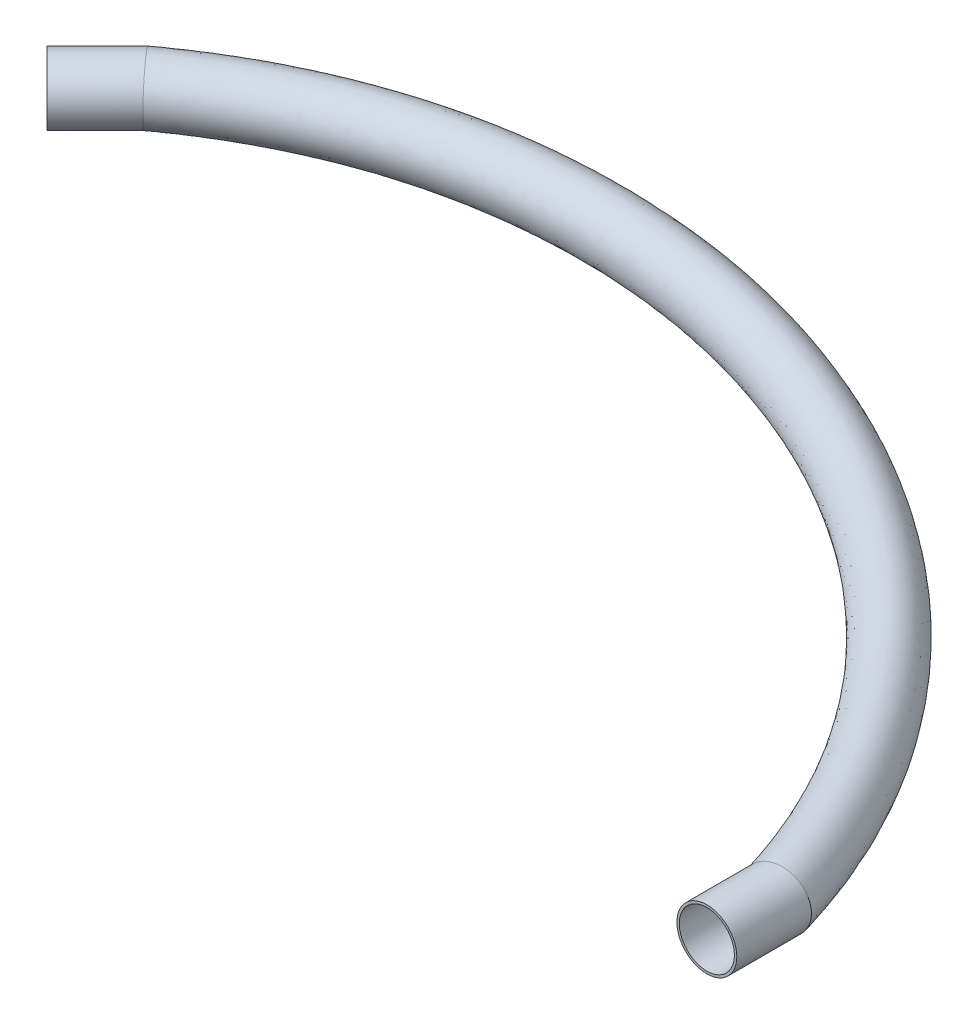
ISO-10303-21;
HEADER;
FILE_DESCRIPTION(('STEP AP214'),'2;1');
FILE_NAME('part.step','',(''),(''),'','','');
FILE_SCHEMA(('AUTOMOTIVE_DESIGN { 1 0 10303 214 1 1 1 1 }'));
ENDSEC;
DATA;
#1=APPLICATION_CONTEXT('core data for automotive mechanical design processes');
#2=APPLICATION_PROTOCOL_DEFINITION('international standard','automotive_design',2000,#1);
#3=PRODUCT_CONTEXT('',#1,'mechanical');
#4=PRODUCT('Part','Part','',(#3));
#5=PRODUCT_RELATED_PRODUCT_CATEGORY('part','',(#4));
#6=PRODUCT_DEFINITION_FORMATION('','',#4);
#7=PRODUCT_DEFINITION_CONTEXT('part definition',#1,'design');
#8=PRODUCT_DEFINITION('design','',#6,#7);
#9=PRODUCT_DEFINITION_SHAPE('','',#8);
#10=(LENGTH_UNIT() NAMED_UNIT(*) SI_UNIT(.MILLI.,.METRE.));
#11=(NAMED_UNIT(*) PLANE_ANGLE_UNIT() SI_UNIT($,.RADIAN.));
#12=(NAMED_UNIT(*) SI_UNIT($,.STERADIAN.) SOLID_ANGLE_UNIT());
#13=UNCERTAINTY_MEASURE_WITH_UNIT(LENGTH_MEASURE(1.E-05),#10,'distance_accuracy_value','');
#14=(GEOMETRIC_REPRESENTATION_CONTEXT(3) GLOBAL_UNCERTAINTY_ASSIGNED_CONTEXT((#13)) GLOBAL_UNIT_ASSIGNED_CONTEXT((#10,
#11,#12)) REPRESENTATION_CONTEXT('',''));
#15=CARTESIAN_POINT('',(0.,0.,0.));
#16=DIRECTION('',(0.,0.,1.));
#17=DIRECTION('',(1.,0.,0.));
#18=AXIS2_PLACEMENT_3D('',#15,#16,#17);
#19=CARTESIAN_POINT('',(-422.375522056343,35.4794525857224,-115.113122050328));
#20=DIRECTION('',(-0.707106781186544,0.,0.707106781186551));
#21=DIRECTION('',(0.707106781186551,0.,0.707106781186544));
#22=AXIS2_PLACEMENT_3D('',#19,#20,#21);
#23=CYLINDRICAL_SURFACE('',#22,21.75);
#24=CARTESIAN_POINT('',(-423.744724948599,13.7294525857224,-113.743919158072));
#25=CARTESIAN_POINT('',(-423.728343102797,13.7294525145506,-113.724813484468));
#26=CARTESIAN_POINT('',(-423.71196087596,13.7294959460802,-113.705707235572));
#27=CARTESIAN_POINT('',(-423.296304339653,13.7317014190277,-113.220932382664));
#28=CARTESIAN_POINT('',(-422.896879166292,13.7596551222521,-112.755010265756));
#29=CARTESIAN_POINT('',(-422.300097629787,13.8401695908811,-112.058760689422));
#30=CARTESIAN_POINT('',(-422.101480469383,13.8734604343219,-111.8270199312));
#31=CARTESIAN_POINT('',(-421.705300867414,13.9528616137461,-111.36473101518));
#32=CARTESIAN_POINT('',(-421.507738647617,13.9989745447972,-111.134183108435));
#33=CARTESIAN_POINT('',(-420.916321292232,14.1566800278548,-110.443963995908));
#34=CARTESIAN_POINT('',(-420.524602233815,14.2875223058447,-109.98672864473));
#35=CARTESIAN_POINT('',(-419.749806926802,14.5995419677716,-109.082199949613));
#36=CARTESIAN_POINT('',(-419.366730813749,14.7807201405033,-108.634906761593));
#37=CARTESIAN_POINT('',(-418.800906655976,15.0891144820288,-107.974125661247));
#38=CARTESIAN_POINT('',(-418.613828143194,15.1979721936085,-107.755633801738));
#39=CARTESIAN_POINT('',(-418.242890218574,15.427693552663,-107.322375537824));
#40=CARTESIAN_POINT('',(-418.059029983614,15.5485540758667,-107.107608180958));
#41=CARTESIAN_POINT('',(-417.512648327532,15.9289161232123,-106.469329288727));
#42=CARTESIAN_POINT('',(-417.15530798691,16.2062079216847,-106.051819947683));
#43=CARTESIAN_POINT('',(-416.457467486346,16.8059325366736,-105.236354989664));
#44=CARTESIAN_POINT('',(-416.116955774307,17.1283337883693,-104.838385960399));
#45=CARTESIAN_POINT('',(-415.45487895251,17.8161887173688,-104.064480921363));
#46=CARTESIAN_POINT('',(-415.133313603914,18.1816418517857,-103.688544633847));
#47=CARTESIAN_POINT('',(-414.511752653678,18.9526298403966,-102.961790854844));
#48=CARTESIAN_POINT('',(-414.211735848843,19.3581243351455,-102.610948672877));
#49=CARTESIAN_POINT('',(-413.635061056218,20.2066402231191,-101.936495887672));
#50=CARTESIAN_POINT('',(-413.358403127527,20.6496617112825,-101.612885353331));
#51=CARTESIAN_POINT('',(-412.830400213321,21.5701503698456,-100.995202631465));
#52=CARTESIAN_POINT('',(-412.579058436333,22.0476218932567,-100.701134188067));
#53=CARTESIAN_POINT('',(-412.103536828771,23.0335676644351,-100.144719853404));
#54=CARTESIAN_POINT('',(-411.879356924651,23.5420418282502,-99.8823738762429));
#55=CARTESIAN_POINT('',(-411.460385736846,24.5848525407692,-99.3920303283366));
#56=CARTESIAN_POINT('',(-411.265511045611,25.1191097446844,-99.1639352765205));
#57=CARTESIAN_POINT('',(-410.90577572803,26.2110481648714,-98.7428442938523));
#58=CARTESIAN_POINT('',(-410.740915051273,26.7687293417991,-98.549848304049));
#59=CARTESIAN_POINT('',(-410.442401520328,27.9035233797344,-98.2003690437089));
#60=CARTESIAN_POINT('',(-410.308747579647,28.4806355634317,-98.04388450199));
#61=CARTESIAN_POINT('',(-410.073605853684,29.6501898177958,-97.7685636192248));
#62=CARTESIAN_POINT('',(-409.972118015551,30.2426318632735,-97.6497272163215));
#63=CARTESIAN_POINT('',(-409.802275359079,31.4369726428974,-97.4508451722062));
#64=CARTESIAN_POINT('',(-409.733830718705,32.0388410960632,-97.3706943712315));
#65=CARTESIAN_POINT('',(-409.630155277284,33.2493231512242,-97.2492853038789));
#66=CARTESIAN_POINT('',(-409.594924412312,33.8579367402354,-97.2080269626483));
#67=CARTESIAN_POINT('',(-409.557930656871,35.0775665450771,-97.1647040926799));
#68=CARTESIAN_POINT('',(-409.556167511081,35.6885827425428,-97.1626392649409));
#69=CARTESIAN_POINT('',(-409.586121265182,36.9086658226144,-97.1977177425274));
#70=CARTESIAN_POINT('',(-409.617838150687,37.5177327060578,-97.2348610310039));
#71=CARTESIAN_POINT('',(-409.714457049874,38.7287476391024,-97.3480070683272));
#72=CARTESIAN_POINT('',(-409.779313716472,39.3307042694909,-97.4239567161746));
#73=CARTESIAN_POINT('',(-409.941721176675,40.5240670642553,-97.6141338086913));
#74=CARTESIAN_POINT('',(-410.039271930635,41.1154732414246,-97.7283612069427));
#75=CARTESIAN_POINT('',(-410.266368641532,42.2835469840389,-97.994265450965));
#76=CARTESIAN_POINT('',(-410.395914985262,42.8602143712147,-98.1459427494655));
#77=CARTESIAN_POINT('',(-410.686073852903,43.9947195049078,-98.485646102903));
#78=CARTESIAN_POINT('',(-410.846686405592,44.5525572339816,-98.6736721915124));
#79=CARTESIAN_POINT('',(-411.197953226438,45.6458473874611,-99.0848581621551));
#80=CARTESIAN_POINT('',(-411.388628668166,46.1812836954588,-99.3080428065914));
#81=CARTESIAN_POINT('',(-411.798576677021,47.2255720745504,-99.7878370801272));
#82=CARTESIAN_POINT('',(-412.01784925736,47.7344241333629,-100.044446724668));
#83=CARTESIAN_POINT('',(-412.483410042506,48.7219221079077,-100.589220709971));
#84=CARTESIAN_POINT('',(-412.729696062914,49.2005704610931,-100.877382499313));
#85=CARTESIAN_POINT('',(-413.247546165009,50.1243454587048,-101.483207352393));
#86=CARTESIAN_POINT('',(-413.519110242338,50.5694721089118,-101.800870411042));
#87=CARTESIAN_POINT('',(-414.086215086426,51.4240260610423,-102.464154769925));
#88=CARTESIAN_POINT('',(-414.381806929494,51.8333732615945,-102.809835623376));
#89=CARTESIAN_POINT('',(-414.994338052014,52.6123975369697,-103.526060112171));
#90=CARTESIAN_POINT('',(-415.311277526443,52.9820742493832,-103.8966039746));
#91=CARTESIAN_POINT('',(-415.964473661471,53.6793872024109,-104.660161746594));
#92=CARTESIAN_POINT('',(-416.300739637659,54.0070029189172,-105.053186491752));
#93=CARTESIAN_POINT('',(-416.817584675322,54.4649033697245,-105.657176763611));
#94=CARTESIAN_POINT('',(-416.991946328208,54.6119537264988,-105.860922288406));
#95=CARTESIAN_POINT('',(-417.344591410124,54.8947055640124,-106.272964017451));
#96=CARTESIAN_POINT('',(-417.522875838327,55.0304041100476,-106.48126138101));
#97=CARTESIAN_POINT('',(-418.065176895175,55.421555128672,-107.114805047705));
#98=CARTESIAN_POINT('',(-418.434684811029,55.6593291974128,-107.546416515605));
#99=CARTESIAN_POINT('',(-419.18549832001,56.0860848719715,-108.423276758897));
#100=CARTESIAN_POINT('',(-419.566803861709,56.2750666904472,-108.868525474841));
#101=CARTESIAN_POINT('',(-420.145178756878,56.520813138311,-109.543779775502));
#102=CARTESIAN_POINT('',(-420.338904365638,56.5964018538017,-109.769936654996));
#103=CARTESIAN_POINT('',(-420.728221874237,56.7349565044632,-110.224391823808));
#104=CARTESIAN_POINT('',(-420.923813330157,56.7979253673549,-110.452689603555));
#105=CARTESIAN_POINT('',(-421.51279179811,56.9676977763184,-111.140098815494));
#106=CARTESIAN_POINT('',(-421.908629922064,57.0554720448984,-111.602014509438));
#107=CARTESIAN_POINT('',(-422.536962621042,57.1535359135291,-112.335113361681));
#108=CARTESIAN_POINT('',(-422.768389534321,57.1808821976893,-112.605101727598));
#109=CARTESIAN_POINT('',(-423.231740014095,57.2181542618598,-113.145605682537));
#110=CARTESIAN_POINT('',(-423.463663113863,57.2280923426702,-113.416120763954));
#111=CARTESIAN_POINT('',(-423.711960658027,57.2294091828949,-113.705706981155));
#112=CARTESIAN_POINT('',(-423.728342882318,57.229452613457,-113.724813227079));
#113=CARTESIAN_POINT('',(-423.744724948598,57.2294525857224,-113.743919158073));
#114=B_SPLINE_CURVE_WITH_KNOTS('',3,(#24,#25,#26,#27,#28,#29,#30,#31,#32,#33,#34,#35,#36,#37,
#38,#39,#40,#41,#42,#43,#44,#45,#46,#47,#48,#49,#50,#51,#52,#53,#54,#55,#56,#57,#58,#59,#60,#61,
#62,#63,#64,#65,#66,#67,#68,#69,#70,#71,#72,#73,#74,#75,#76,#77,#78,#79,#80,#81,#82,#83,#84,#85,
#86,#87,#88,#89,#90,#91,#92,#93,#94,#95,#96,#97,#98,#99,#100,#101,#102,#103,#104,#105,#106,#107,
#108,#109,#110,#111,#112,#113),.UNSPECIFIED.,.F.,.F.,(4,2,2,2,2,2,2,2,2,2,2,2,2,2,2,2,2,2,2,2,2,
2,2,2,2,2,2,2,2,2,2,2,2,2,2,2,2,2,2,2,2,2,2,2,4),(0.,0.0755037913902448,1.91568321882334,
2.8365445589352,3.7575924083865,5.60368602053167,7.44980856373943,8.37221835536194,
9.29438867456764,11.1386416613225,12.9816105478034,14.82455619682,16.6656628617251,
18.5067741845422,20.3481185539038,22.1894579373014,24.025453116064,25.8614452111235,
27.6973733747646,29.5332985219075,31.364204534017,33.1951070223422,35.0259955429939,
36.8568832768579,38.685272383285,40.5136592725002,42.3420682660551,44.1704789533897,
46.0001832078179,47.8298883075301,49.6594455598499,51.4890024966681,53.3225557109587,
55.1561256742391,56.9905869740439,57.907874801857,58.8253990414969,60.670832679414,
62.5162582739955,63.4377043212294,64.3589363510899,66.2002222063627,67.2698466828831,
68.3387150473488,68.4142188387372),.UNSPECIFIED.);
#115=CARTESIAN_POINT('',(-423.744724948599,13.7294525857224,-113.743919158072));
#116=VERTEX_POINT('',#115);
#117=CARTESIAN_POINT('',(-423.744724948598,57.2294525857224,-113.743919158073));
#118=VERTEX_POINT('',#117);
#119=EDGE_CURVE('E62',#116,#118,#114,.T.);
#120=ORIENTED_EDGE('',*,*,#119,.T.);
#121=CARTESIAN_POINT('',(-423.744724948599,13.7294525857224,-113.743919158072));
#122=CARTESIAN_POINT('',(-423.761106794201,13.7294525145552,-113.763024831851));
#123=CARTESIAN_POINT('',(-423.777489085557,13.7294959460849,-113.782131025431));
#124=CARTESIAN_POINT('',(-424.193110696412,13.7317012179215,-114.266858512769));
#125=CARTESIAN_POINT('',(-424.592539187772,13.7596498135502,-114.732700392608));
#126=CARTESIAN_POINT('',(-425.18938279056,13.8401507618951,-115.428781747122));
#127=CARTESIAN_POINT('',(-425.388030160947,13.8734361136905,-115.660458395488));
#128=CARTESIAN_POINT('',(-425.784288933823,13.9528245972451,-116.122603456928));
#129=CARTESIAN_POINT('',(-425.981900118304,13.9989303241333,-116.353071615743));
#130=CARTESIAN_POINT('',(-426.573492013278,14.156611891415,-117.043027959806));
#131=CARTESIAN_POINT('',(-426.965364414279,14.2874352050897,-117.500057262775));
#132=CARTESIAN_POINT('',(-427.740535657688,14.5994126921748,-118.404116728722));
#133=CARTESIAN_POINT('',(-428.123834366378,14.7805676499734,-118.851146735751));
#134=CARTESIAN_POINT('',(-428.690039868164,15.088925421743,-119.511495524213));
#135=CARTESIAN_POINT('',(-428.877253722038,15.1977709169,-119.72983751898));
#136=CARTESIAN_POINT('',(-429.248476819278,15.4274673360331,-120.162784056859));
#137=CARTESIAN_POINT('',(-429.432486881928,15.5483151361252,-120.37738955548));
#138=CARTESIAN_POINT('',(-429.979338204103,15.9286383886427,-121.015166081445));
#139=CARTESIAN_POINT('',(-430.337018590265,16.2059034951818,-121.432318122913));
#140=CARTESIAN_POINT('',(-431.035582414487,16.8055733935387,-122.24703239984));
#141=CARTESIAN_POINT('',(-431.376477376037,17.1279466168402,-122.644608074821));
#142=CARTESIAN_POINT('',(-432.039352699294,17.8157439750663,-123.417699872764));
#143=CARTESIAN_POINT('',(-432.361333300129,18.1811675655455,-123.793216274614));
#144=CARTESIAN_POINT('',(-432.983726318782,18.9520726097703,-124.519094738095));
#145=CARTESIAN_POINT('',(-433.284161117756,19.3575114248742,-124.869482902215));
#146=CARTESIAN_POINT('',(-433.861681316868,20.2059089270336,-125.543027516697));
#147=CARTESIAN_POINT('',(-434.138766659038,20.6488677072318,-125.866183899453));
#148=CARTESIAN_POINT('',(-434.667621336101,21.5692236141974,-126.482971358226));
#149=CARTESIAN_POINT('',(-434.919387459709,22.0466250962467,-126.776598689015));
#150=CARTESIAN_POINT('',(-435.395742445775,23.0324232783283,-127.332157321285));
#151=CARTESIAN_POINT('',(-435.620331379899,23.5408198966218,-127.594088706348));
#152=CARTESIAN_POINT('',(-436.040104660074,24.5834979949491,-128.08365778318));
#153=CARTESIAN_POINT('',(-436.23537086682,25.1177016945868,-128.311390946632));
#154=CARTESIAN_POINT('',(-436.595849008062,26.2095290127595,-128.731805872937));
#155=CARTESIAN_POINT('',(-436.761060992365,26.7671525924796,-128.924487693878));
#156=CARTESIAN_POINT('',(-437.060228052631,27.9018284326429,-129.273397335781));
#157=CARTESIAN_POINT('',(-437.194184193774,28.4788800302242,-129.429626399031));
#158=CARTESIAN_POINT('',(-437.42987371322,29.6483110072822,-129.7045040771));
#159=CARTESIAN_POINT('',(-437.531607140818,30.2406903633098,-129.823152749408));
#160=CARTESIAN_POINT('',(-437.701890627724,31.4349937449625,-130.021749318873));
#161=CARTESIAN_POINT('',(-437.770525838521,32.0368891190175,-130.101796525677));
#162=CARTESIAN_POINT('',(-437.87450662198,33.2474283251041,-130.223066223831));
#163=CARTESIAN_POINT('',(-437.909852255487,33.8560721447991,-130.264288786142));
#164=CARTESIAN_POINT('',(-437.946997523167,35.075766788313,-130.307610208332));
#165=CARTESIAN_POINT('',(-437.948797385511,35.6868175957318,-130.309709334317));
#166=CARTESIAN_POINT('',(-437.918838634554,36.9069744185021,-130.274769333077));
#167=CARTESIAN_POINT('',(-437.887080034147,37.5160804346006,-130.237730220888));
#168=CARTESIAN_POINT('',(-437.790296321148,38.7272364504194,-130.124854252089));
#169=CARTESIAN_POINT('',(-437.725313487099,39.3292944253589,-130.049066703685));
#170=CARTESIAN_POINT('',(-437.562574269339,40.5228627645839,-129.859268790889));
#171=CARTESIAN_POINT('',(-437.464817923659,41.1143731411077,-129.745258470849));
#172=CARTESIAN_POINT('',(-437.237236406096,42.2826554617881,-129.479836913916));
#173=CARTESIAN_POINT('',(-437.10741091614,42.8594272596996,-129.328425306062));
#174=CARTESIAN_POINT('',(-436.816627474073,43.9941409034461,-128.989293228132));
#175=CARTESIAN_POINT('',(-436.655669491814,44.5520827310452,-128.801572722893));
#176=CARTESIAN_POINT('',(-436.3036639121,45.6455493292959,-128.391039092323));
#177=CARTESIAN_POINT('',(-436.11259669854,46.1810591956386,-128.168203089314));
#178=CARTESIAN_POINT('',(-435.701822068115,47.2254919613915,-127.689128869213));
#179=CARTESIAN_POINT('',(-435.482114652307,47.7344148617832,-127.432890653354));
#180=CARTESIAN_POINT('',(-435.015650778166,48.72205441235,-126.888867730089));
#181=CARTESIAN_POINT('',(-434.768896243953,49.2007732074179,-126.601085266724));
#182=CARTESIAN_POINT('',(-434.250090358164,50.1246812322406,-125.996017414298));
#183=CARTESIAN_POINT('',(-433.978038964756,50.5698704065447,-125.678731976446));
#184=CARTESIAN_POINT('',(-433.409150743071,51.4257457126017,-125.015254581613));
#185=CARTESIAN_POINT('',(-433.112196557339,51.8362477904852,-124.668925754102));
#186=CARTESIAN_POINT('',(-432.496834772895,52.6173364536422,-123.951247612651));
#187=CARTESIAN_POINT('',(-432.178426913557,52.9879225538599,-123.579897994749));
#188=CARTESIAN_POINT('',(-431.522223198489,53.6867832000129,-122.814587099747));
#189=CARTESIAN_POINT('',(-431.184418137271,54.0150374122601,-122.420615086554));
#190=CARTESIAN_POINT('',(-430.66523805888,54.4736787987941,-121.815110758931));
#191=CARTESIAN_POINT('',(-430.490093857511,54.6209398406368,-121.610845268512));
#192=CARTESIAN_POINT('',(-430.135878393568,54.9040394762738,-121.197734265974));
#193=CARTESIAN_POINT('',(-429.956806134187,55.0398751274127,-120.988887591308));
#194=CARTESIAN_POINT('',(-429.414055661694,55.4299426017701,-120.35589377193));
#195=CARTESIAN_POINT('',(-429.044961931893,55.6666305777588,-119.925430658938));
#196=CARTESIAN_POINT('',(-428.295117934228,56.0914255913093,-119.050909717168));
#197=CARTESIAN_POINT('',(-427.914367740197,56.2795329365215,-118.6068519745));
#198=CARTESIAN_POINT('',(-427.336923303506,56.5241366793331,-117.933395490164));
#199=CARTESIAN_POINT('',(-427.143524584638,56.5993726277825,-117.707840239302));
#200=CARTESIAN_POINT('',(-426.754891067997,56.7372794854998,-117.25458835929));
#201=CARTESIAN_POINT('',(-426.559656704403,56.7999532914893,-117.026892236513));
#202=CARTESIAN_POINT('',(-425.971791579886,56.968929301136,-116.341282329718));
#203=CARTESIAN_POINT('',(-425.576753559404,57.0562899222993,-115.880561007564));
#204=CARTESIAN_POINT('',(-424.949775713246,57.1538895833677,-115.149334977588));
#205=CARTESIAN_POINT('',(-424.718871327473,57.1811059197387,-114.880037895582));
#206=CARTESIAN_POINT('',(-424.25659471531,57.2182027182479,-114.340898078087));
#207=CARTESIAN_POINT('',(-424.025222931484,57.2280953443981,-114.071055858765));
#208=CARTESIAN_POINT('',(-423.777489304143,57.229409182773,-113.782131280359));
#209=CARTESIAN_POINT('',(-423.761107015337,57.2294526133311,-113.763025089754));
#210=CARTESIAN_POINT('',(-423.744724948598,57.2294525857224,-113.743919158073));
#211=B_SPLINE_CURVE_WITH_KNOTS('',3,(#121,#122,#123,#124,#125,#126,#127,#128,#129,#130,#131,
#132,#133,#134,#135,#136,#137,#138,#139,#140,#141,#142,#143,#144,#145,#146,#147,#148,#149,#150,
#151,#152,#153,#154,#155,#156,#157,#158,#159,#160,#161,#162,#163,#164,#165,#166,#167,#168,#169,
#170,#171,#172,#173,#174,#175,#176,#177,#178,#179,#180,#181,#182,#183,#184,#185,#186,#187,#188,
#189,#190,#191,#192,#193,#194,#195,#196,#197,#198,#199,#200,#201,#202,#203,#204,#205,#206,#207,
#208,#209,#210),.UNSPECIFIED.,.F.,.F.,(4,2,2,2,2,2,2,2,2,2,2,2,2,2,2,2,2,2,2,2,2,2,2,2,2,2,2,2,
2,2,2,2,2,2,2,2,2,2,2,2,2,2,2,2,4),(0.,0.0755037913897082,1.91550714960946,2.83628021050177,
3.75723979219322,5.60315549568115,7.44909996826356,8.37142455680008,9.29350971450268,
11.1375923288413,12.9803907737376,14.8231659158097,16.6639982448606,18.5048351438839,
20.3459052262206,22.1869704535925,24.0227963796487,25.8586192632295,27.6943795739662,
29.5301370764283,31.3611462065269,33.1921519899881,35.0231453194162,36.8541379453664,
38.6828063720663,40.5114726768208,42.3401571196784,44.1688433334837,45.9987258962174,
47.8286083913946,49.6583607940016,51.4881162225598,53.3270396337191,55.1659853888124,
57.0058111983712,57.9257791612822,58.8459833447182,60.6870179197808,62.5280408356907,
63.4472815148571,64.3663099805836,66.2031981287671,67.270208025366,68.3364684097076,
68.4119722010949),.UNSPECIFIED.);
#212=EDGE_CURVE('E19',#116,#118,#211,.T.);
#213=ORIENTED_EDGE('',*,*,#212,.F.);
#214=EDGE_LOOP('',(#120,#213));
#215=FACE_BOUND('',#214,.T.);
#216=CARTESIAN_POINT('',(-459.807170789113,35.4794525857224,-77.6814733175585));
#217=DIRECTION('',(0.707106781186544,0.,-0.707106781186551));
#218=DIRECTION('',(-0.707106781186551,0.,-0.707106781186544));
#219=AXIS2_PLACEMENT_3D('',#216,#217,#218);
#220=CIRCLE('',#219,21.75);
#221=CARTESIAN_POINT('',(-475.18674327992,35.4794525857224,-93.0610458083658));
#222=VERTEX_POINT('',#221);
#223=EDGE_CURVE('E34',#222,#222,#220,.T.);
#224=ORIENTED_EDGE('',*,*,#223,.T.);
#225=EDGE_LOOP('',(#224));
#226=FACE_BOUND('',#225,.T.);
#227=ADVANCED_FACE('F16',(#215,#226),#23,.T.);
#228=CARTESIAN_POINT('',(336.625081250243,35.4794525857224,163.97466984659));
#229=CARTESIAN_POINT('',(336.453182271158,35.4794525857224,163.399768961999));
#230=CARTESIAN_POINT('',(336.281283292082,35.4794525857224,162.824868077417));
#231=CARTESIAN_POINT('',(335.937485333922,35.4794525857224,161.675066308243));
#232=CARTESIAN_POINT('',(335.769666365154,35.4794525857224,161.113809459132));
#233=CARTESIAN_POINT('',(335.413942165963,35.4794525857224,159.924123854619));
#234=CARTESIAN_POINT('',(335.224676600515,35.4794525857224,159.295636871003));
#235=CARTESIAN_POINT('',(334.852111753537,35.4794525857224,158.06759229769));
#236=CARTESIAN_POINT('',(334.664645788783,35.4794525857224,157.454098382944));
#237=CARTESIAN_POINT('',(334.098707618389,35.4794525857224,155.615207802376));
#238=CARTESIAN_POINT('',(333.716695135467,35.4794525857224,154.391402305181));
#239=CARTESIAN_POINT('',(332.556579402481,35.4794525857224,150.726398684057));
#240=CARTESIAN_POINT('',(331.76439785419,35.4794525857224,148.291613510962));
#241=CARTESIAN_POINT('',(329.332203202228,35.4794525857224,141.013292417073));
#242=CARTESIAN_POINT('',(327.636539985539,35.4794525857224,136.195792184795));
#243=CARTESIAN_POINT('',(322.332261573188,35.4794525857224,121.850448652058));
#244=CARTESIAN_POINT('',(318.506359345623,35.4794525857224,112.429781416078));
#245=CARTESIAN_POINT('',(306.202002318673,35.4794525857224,84.6198834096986));
#246=CARTESIAN_POINT('',(296.897007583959,35.4794525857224,66.6829926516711));
#247=CARTESIAN_POINT('',(266.013429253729,35.4794525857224,14.8589437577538));
#248=CARTESIAN_POINT('',(241.468987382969,35.4794525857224,-17.0403363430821));
#249=CARTESIAN_POINT('',(158.591386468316,35.4794525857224,-103.46330892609));
#250=CARTESIAN_POINT('',(91.0351595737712,35.4794525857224,-148.741564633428));
#251=CARTESIAN_POINT('',(-18.8635760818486,35.4794525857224,-192.808533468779));
#252=CARTESIAN_POINT('',(-56.931224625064,35.4794525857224,-203.517332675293));
#253=CARTESIAN_POINT('',(-134.30120179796,35.4794525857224,-215.991873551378));
#254=CARTESIAN_POINT('',(-173.606694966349,35.4794525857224,-217.756080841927));
#255=CARTESIAN_POINT('',(-251.737313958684,35.4794525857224,-211.298404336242));
#256=CARTESIAN_POINT('',(-290.563575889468,35.4794525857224,-203.071117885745));
#257=CARTESIAN_POINT('',(-347.031454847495,35.4794525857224,-182.487135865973));
#258=CARTESIAN_POINT('',(-365.55733184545,35.4794525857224,-174.252919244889));
#259=CARTESIAN_POINT('',(-392.716040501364,35.4794525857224,-159.762864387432));
#260=CARTESIAN_POINT('',(-401.66389836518,35.4794525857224,-154.576515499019));
#261=CARTESIAN_POINT('',(-414.905034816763,35.4794525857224,-146.253706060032));
#262=CARTESIAN_POINT('',(-419.288640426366,35.4794525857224,-143.388896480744));
#263=CARTESIAN_POINT('',(-425.816029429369,35.4794525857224,-138.954841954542));
#264=CARTESIAN_POINT('',(-427.983822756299,35.4794525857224,-137.4540175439));
#265=CARTESIAN_POINT('',(-431.223153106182,35.4794525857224,-135.168446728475));
#266=CARTESIAN_POINT('',(-432.300869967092,35.4794525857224,-134.400867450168));
#267=CARTESIAN_POINT('',(-433.91431114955,35.4794525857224,-133.24089965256));
#268=CARTESIAN_POINT('',(-434.45160252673,35.4794525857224,-132.852810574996));
#269=CARTESIAN_POINT('',(-435.525133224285,35.4794525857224,-132.073763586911));
#270=CARTESIAN_POINT('',(-436.07433072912,35.4794525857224,-131.673313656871));
#271=CARTESIAN_POINT('',(-437.13102406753,35.4794525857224,-130.899313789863));
#272=CARTESIAN_POINT('',(-437.638494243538,35.4794525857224,-130.527604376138));
#273=CARTESIAN_POINT('',(-438.159200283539,35.4794525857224,-130.146200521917));
#274=CARTESIAN_POINT('',(336.625081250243,78.9794525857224,163.97466984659));
#275=CARTESIAN_POINT('',(336.453182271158,78.9794525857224,163.399768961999));
#276=CARTESIAN_POINT('',(336.281283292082,78.9794525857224,162.824868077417));
#277=CARTESIAN_POINT('',(335.937485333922,78.9794525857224,161.675066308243));
#278=CARTESIAN_POINT('',(335.769666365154,78.9794525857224,161.113809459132));
#279=CARTESIAN_POINT('',(335.413942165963,78.9794525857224,159.924123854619));
#280=CARTESIAN_POINT('',(335.224676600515,78.9794525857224,159.295636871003));
#281=CARTESIAN_POINT('',(334.852111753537,78.9794525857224,158.06759229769));
#282=CARTESIAN_POINT('',(334.664645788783,78.9794525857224,157.454098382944));
#283=CARTESIAN_POINT('',(334.098707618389,78.9794525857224,155.615207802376));
#284=CARTESIAN_POINT('',(333.716695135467,78.9794525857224,154.391402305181));
#285=CARTESIAN_POINT('',(332.556579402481,78.9794525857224,150.726398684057));
#286=CARTESIAN_POINT('',(331.76439785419,78.9794525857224,148.291613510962));
#287=CARTESIAN_POINT('',(329.332203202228,78.9794525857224,141.013292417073));
#288=CARTESIAN_POINT('',(327.636539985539,78.9794525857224,136.195792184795));
#289=CARTESIAN_POINT('',(322.332261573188,78.9794525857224,121.850448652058));
#290=CARTESIAN_POINT('',(318.506359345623,78.9794525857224,112.429781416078));
#291=CARTESIAN_POINT('',(306.202002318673,78.9794525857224,84.6198834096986));
#292=CARTESIAN_POINT('',(296.897007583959,78.9794525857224,66.6829926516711));
#293=CARTESIAN_POINT('',(266.013429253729,78.9794525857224,14.8589437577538));
#294=CARTESIAN_POINT('',(241.468987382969,78.9794525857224,-17.0403363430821));
#295=CARTESIAN_POINT('',(158.591386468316,78.9794525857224,-103.46330892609));
#296=CARTESIAN_POINT('',(91.0351595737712,78.9794525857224,-148.741564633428));
#297=CARTESIAN_POINT('',(-18.8635760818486,78.9794525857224,-192.808533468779));
#298=CARTESIAN_POINT('',(-56.931224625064,78.9794525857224,-203.517332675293));
#299=CARTESIAN_POINT('',(-134.301201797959,78.9794525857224,-215.991873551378));
#300=CARTESIAN_POINT('',(-173.606694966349,78.9794525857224,-217.756080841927));
#301=CARTESIAN_POINT('',(-251.737313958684,78.9794525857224,-211.298404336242));
#302=CARTESIAN_POINT('',(-290.563575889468,78.9794525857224,-203.071117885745));
#303=CARTESIAN_POINT('',(-347.031454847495,78.9794525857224,-182.487135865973));
#304=CARTESIAN_POINT('',(-365.55733184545,78.9794525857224,-174.252919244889));
#305=CARTESIAN_POINT('',(-392.716040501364,78.9794525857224,-159.762864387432));
#306=CARTESIAN_POINT('',(-401.66389836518,78.9794525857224,-154.576515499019));
#307=CARTESIAN_POINT('',(-414.905034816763,78.9794525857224,-146.253706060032));
#308=CARTESIAN_POINT('',(-419.288640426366,78.9794525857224,-143.388896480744));
#309=CARTESIAN_POINT('',(-425.816029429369,78.9794525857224,-138.954841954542));
#310=CARTESIAN_POINT('',(-427.983822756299,78.9794525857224,-137.4540175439));
#311=CARTESIAN_POINT('',(-431.223153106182,78.9794525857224,-135.168446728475));
#312=CARTESIAN_POINT('',(-432.300869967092,78.9794525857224,-134.400867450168));
#313=CARTESIAN_POINT('',(-433.91431114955,78.9794525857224,-133.24089965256));
#314=CARTESIAN_POINT('',(-434.45160252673,78.9794525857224,-132.852810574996));
#315=CARTESIAN_POINT('',(-435.525133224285,78.9794525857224,-132.073763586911));
#316=CARTESIAN_POINT('',(-436.07433072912,78.9794525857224,-131.673313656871));
#317=CARTESIAN_POINT('',(-437.13102406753,78.9794525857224,-130.899313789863));
#318=CARTESIAN_POINT('',(-437.638494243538,78.9794525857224,-130.527604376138));
#319=CARTESIAN_POINT('',(-438.159200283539,78.9794525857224,-130.146200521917));
#320=CARTESIAN_POINT('',(294.948256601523,78.9794525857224,176.436302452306));
#321=CARTESIAN_POINT('',(294.776357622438,78.9794525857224,175.861401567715));
#322=CARTESIAN_POINT('',(294.604458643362,78.9794525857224,175.286500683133));
#323=CARTESIAN_POINT('',(294.260660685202,78.9794525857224,174.136698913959));
#324=CARTESIAN_POINT('',(294.084682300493,78.9794525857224,173.548153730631));
#325=CARTESIAN_POINT('',(293.745451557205,78.9794525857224,172.413628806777));
#326=CARTESIAN_POINT('',(293.581290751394,78.9794525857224,171.868695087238));
#327=CARTESIAN_POINT('',(293.242471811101,78.9794525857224,170.751883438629));
#328=CARTESIAN_POINT('',(293.071980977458,78.9794525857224,170.19394156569));
#329=CARTESIAN_POINT('',(292.55727300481,78.9794525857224,168.521512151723));
#330=CARTESIAN_POINT('',(292.20982039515,78.9794525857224,167.408420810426));
#331=CARTESIAN_POINT('',(291.15458958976,78.9794525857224,164.074766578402));
#332=CARTESIAN_POINT('',(290.433938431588,78.9794525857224,161.859823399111));
#333=CARTESIAN_POINT('',(288.221043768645,78.9794525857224,155.23775559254));
#334=CARTESIAN_POINT('',(286.677859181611,78.9794525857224,150.853391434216));
#335=CARTESIAN_POINT('',(281.848940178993,78.9794525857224,137.793650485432));
#336=CARTESIAN_POINT('',(278.36383879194,78.9794525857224,129.21160632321));
#337=CARTESIAN_POINT('',(267.146255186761,78.9794525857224,103.857997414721));
#338=CARTESIAN_POINT('',(258.651383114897,78.9794525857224,87.4787199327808));
#339=CARTESIAN_POINT('',(230.401131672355,78.9794525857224,40.0735133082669));
#340=CARTESIAN_POINT('',(207.877381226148,78.9794525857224,10.7789553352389));
#341=CARTESIAN_POINT('',(131.585406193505,78.9794525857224,-68.7766687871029));
#342=CARTESIAN_POINT('',(69.0752504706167,78.9794525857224,-110.680254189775));
#343=CARTESIAN_POINT('',(-32.1679121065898,78.9794525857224,-151.276529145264));
#344=CARTESIAN_POINT('',(-67.1546170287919,78.9794525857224,-161.103891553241));
#345=CARTESIAN_POINT('',(-137.926175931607,78.9794525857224,-172.514554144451));
#346=CARTESIAN_POINT('',(-173.707865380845,78.9794525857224,-174.099388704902));
#347=CARTESIAN_POINT('',(-244.469828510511,78.9794525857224,-168.250748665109));
#348=CARTESIAN_POINT('',(-279.448966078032,78.9794525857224,-160.82267672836));
#349=CARTESIAN_POINT('',(-330.241889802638,78.9794525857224,-142.30736062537));
#350=CARTESIAN_POINT('',(-346.895064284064,78.9794525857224,-134.90576778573));
#351=CARTESIAN_POINT('',(-371.332363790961,78.9794525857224,-121.867673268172));
#352=CARTESIAN_POINT('',(-379.38774714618,78.9794525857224,-117.198899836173));
#353=CARTESIAN_POINT('',(-391.319487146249,78.9794525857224,-109.699120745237));
#354=CARTESIAN_POINT('',(-395.271509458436,78.9794525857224,-107.116416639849));
#355=CARTESIAN_POINT('',(-401.159710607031,78.9794525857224,-103.116562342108));
#356=CARTESIAN_POINT('',(-403.11580537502,78.9794525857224,-101.762310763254));
#357=CARTESIAN_POINT('',(-406.039737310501,78.9794525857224,-99.6992752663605));
#358=CARTESIAN_POINT('',(-407.012679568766,78.9794525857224,-99.0063203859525));
#359=CARTESIAN_POINT('',(-408.469508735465,78.9794525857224,-97.9589472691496));
#360=CARTESIAN_POINT('',(-408.954687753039,78.9794525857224,-97.6084994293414));
#361=CARTESIAN_POINT('',(-409.924179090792,78.9794525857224,-96.904952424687));
#362=CARTESIAN_POINT('',(-410.39553297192,78.9794525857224,-96.5613445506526));
#363=CARTESIAN_POINT('',(-411.39983816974,78.9794525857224,-95.8257175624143));
#364=CARTESIAN_POINT('',(-411.9337798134,78.9794525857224,-95.4346185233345));
#365=CARTESIAN_POINT('',(-412.454485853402,78.9794525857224,-95.0532146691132));
#366=CARTESIAN_POINT('',(294.948256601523,35.4794525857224,176.436302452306));
#367=CARTESIAN_POINT('',(294.776357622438,35.4794525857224,175.861401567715));
#368=CARTESIAN_POINT('',(294.604458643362,35.4794525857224,175.286500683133));
#369=CARTESIAN_POINT('',(294.260660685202,35.4794525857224,174.136698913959));
#370=CARTESIAN_POINT('',(294.084682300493,35.4794525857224,173.548153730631));
#371=CARTESIAN_POINT('',(293.745451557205,35.4794525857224,172.413628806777));
#372=CARTESIAN_POINT('',(293.581290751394,35.4794525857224,171.868695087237));
#373=CARTESIAN_POINT('',(293.242471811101,35.4794525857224,170.75188343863));
#374=CARTESIAN_POINT('',(293.071980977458,35.4794525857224,170.19394156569));
#375=CARTESIAN_POINT('',(292.55727300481,35.4794525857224,168.521512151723));
#376=CARTESIAN_POINT('',(292.20982039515,35.4794525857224,167.408420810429));
#377=CARTESIAN_POINT('',(291.15458958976,35.4794525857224,164.074766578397));
#378=CARTESIAN_POINT('',(290.433938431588,35.4794525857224,161.859823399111));
#379=CARTESIAN_POINT('',(288.221043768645,35.4794525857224,155.23775559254));
#380=CARTESIAN_POINT('',(286.677859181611,35.4794525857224,150.853391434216));
#381=CARTESIAN_POINT('',(281.848940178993,35.4794525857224,137.793650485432));
#382=CARTESIAN_POINT('',(278.36383879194,35.4794525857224,129.211606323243));
#383=CARTESIAN_POINT('',(267.146255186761,35.4794525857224,103.857997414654));
#384=CARTESIAN_POINT('',(258.651383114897,35.4794525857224,87.4787199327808));
#385=CARTESIAN_POINT('',(230.401131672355,35.4794525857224,40.073513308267));
#386=CARTESIAN_POINT('',(207.877381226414,35.4794525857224,10.7789553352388));
#387=CARTESIAN_POINT('',(131.585406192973,35.4794525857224,-68.7766687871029));
#388=CARTESIAN_POINT('',(69.0752504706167,35.4794525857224,-110.680254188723));
#389=CARTESIAN_POINT('',(-32.1679121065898,35.4794525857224,-151.27652914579));
#390=CARTESIAN_POINT('',(-67.1546170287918,35.4794525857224,-161.10389155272));
#391=CARTESIAN_POINT('',(-137.926175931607,35.4794525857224,-172.514554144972));
#392=CARTESIAN_POINT('',(-173.707865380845,35.4794525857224,-174.099388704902));
#393=CARTESIAN_POINT('',(-244.469828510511,35.4794525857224,-168.250748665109));
#394=CARTESIAN_POINT('',(-279.448966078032,35.4794525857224,-160.82267672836));
#395=CARTESIAN_POINT('',(-330.241889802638,35.4794525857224,-142.30736062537));
#396=CARTESIAN_POINT('',(-346.895064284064,35.4794525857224,-134.90576778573));
#397=CARTESIAN_POINT('',(-371.332363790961,35.4794525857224,-121.867673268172));
#398=CARTESIAN_POINT('',(-379.38774714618,35.4794525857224,-117.198899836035));
#399=CARTESIAN_POINT('',(-391.319487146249,35.4794525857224,-109.699120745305));
#400=CARTESIAN_POINT('',(-395.271509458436,35.4794525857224,-107.116416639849));
#401=CARTESIAN_POINT('',(-401.159710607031,35.4794525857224,-103.116562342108));
#402=CARTESIAN_POINT('',(-403.11580537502,35.4794525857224,-101.762310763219));
#403=CARTESIAN_POINT('',(-406.039737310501,35.4794525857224,-99.699275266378));
#404=CARTESIAN_POINT('',(-407.012679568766,35.4794525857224,-99.0063203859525));
#405=CARTESIAN_POINT('',(-408.469508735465,35.4794525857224,-97.9589472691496));
#406=CARTESIAN_POINT('',(-408.954687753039,35.4794525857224,-97.6084994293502));
#407=CARTESIAN_POINT('',(-409.924179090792,35.4794525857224,-96.9049524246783));
#408=CARTESIAN_POINT('',(-410.395532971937,35.4794525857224,-96.5613445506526));
#409=CARTESIAN_POINT('',(-411.399838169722,35.4794525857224,-95.8257175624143));
#410=CARTESIAN_POINT('',(-411.9337798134,35.4794525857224,-95.4346185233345));
#411=CARTESIAN_POINT('',(-412.454485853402,35.4794525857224,-95.0532146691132));
#412=CARTESIAN_POINT('',(294.948256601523,-8.02054741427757,176.436302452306));
#413=CARTESIAN_POINT('',(294.776357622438,-8.02054741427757,175.861401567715));
#414=CARTESIAN_POINT('',(294.604458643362,-8.02054741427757,175.286500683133));
#415=CARTESIAN_POINT('',(294.260660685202,-8.02054741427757,174.136698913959));
#416=CARTESIAN_POINT('',(294.084682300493,-8.02054741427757,173.548153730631));
#417=CARTESIAN_POINT('',(293.745451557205,-8.02054741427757,172.413628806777));
#418=CARTESIAN_POINT('',(293.581290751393,-8.02054741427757,171.868695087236));
#419=CARTESIAN_POINT('',(293.242471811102,-8.02054741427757,170.751883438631));
#420=CARTESIAN_POINT('',(293.071980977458,-8.02054741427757,170.19394156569));
#421=CARTESIAN_POINT('',(292.55727300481,-8.02054741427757,168.521512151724));
#422=CARTESIAN_POINT('',(292.20982039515,-8.02054741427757,167.408420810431));
#423=CARTESIAN_POINT('',(291.15458958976,-8.02054741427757,164.074766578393));
#424=CARTESIAN_POINT('',(290.433938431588,-8.02054741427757,161.859823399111));
#425=CARTESIAN_POINT('',(288.221043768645,-8.02054741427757,155.23775559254));
#426=CARTESIAN_POINT('',(286.677859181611,-8.02054741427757,150.853391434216));
#427=CARTESIAN_POINT('',(281.848940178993,-8.02054741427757,137.793650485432));
#428=CARTESIAN_POINT('',(278.36383879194,-8.02054741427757,129.211606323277));
#429=CARTESIAN_POINT('',(267.146255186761,-8.02054741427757,103.857997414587));
#430=CARTESIAN_POINT('',(258.651383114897,-8.02054741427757,87.4787199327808));
#431=CARTESIAN_POINT('',(230.401131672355,-8.02054741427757,40.073513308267));
#432=CARTESIAN_POINT('',(207.87738122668,-8.02054741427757,10.7789553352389));
#433=CARTESIAN_POINT('',(131.585406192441,-8.02054741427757,-68.7766687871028));
#434=CARTESIAN_POINT('',(69.0752504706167,-8.02054741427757,-110.680254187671));
#435=CARTESIAN_POINT('',(-32.1679121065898,-8.02054741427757,-151.276529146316));
#436=CARTESIAN_POINT('',(-67.1546170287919,-8.02054741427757,-161.1038915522));
#437=CARTESIAN_POINT('',(-137.926175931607,-8.02054741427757,-172.514554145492));
#438=CARTESIAN_POINT('',(-173.707865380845,-8.02054741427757,-174.099388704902));
#439=CARTESIAN_POINT('',(-244.469828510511,-8.02054741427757,-168.250748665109));
#440=CARTESIAN_POINT('',(-279.448966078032,-8.02054741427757,-160.82267672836));
#441=CARTESIAN_POINT('',(-330.241889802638,-8.02054741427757,-142.30736062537));
#442=CARTESIAN_POINT('',(-346.895064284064,-8.02054741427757,-134.90576778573));
#443=CARTESIAN_POINT('',(-371.332363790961,-8.02054741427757,-121.867673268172));
#444=CARTESIAN_POINT('',(-379.38774714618,-8.02054741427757,-117.198899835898));
#445=CARTESIAN_POINT('',(-391.319487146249,-8.02054741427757,-109.699120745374));
#446=CARTESIAN_POINT('',(-395.271509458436,-8.02054741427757,-107.116416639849));
#447=CARTESIAN_POINT('',(-401.159710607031,-8.02054741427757,-103.116562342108));
#448=CARTESIAN_POINT('',(-403.11580537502,-8.02054741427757,-101.762310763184));
#449=CARTESIAN_POINT('',(-406.039737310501,-8.02054741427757,-99.6992752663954));
#450=CARTESIAN_POINT('',(-407.012679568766,-8.02054741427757,-99.0063203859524));
#451=CARTESIAN_POINT('',(-408.469508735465,-8.02054741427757,-97.9589472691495));
#452=CARTESIAN_POINT('',(-408.954687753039,-8.02054741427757,-97.6084994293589));
#453=CARTESIAN_POINT('',(-409.924179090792,-8.02054741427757,-96.9049524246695));
#454=CARTESIAN_POINT('',(-410.395532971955,-8.02054741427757,-96.5613445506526));
#455=CARTESIAN_POINT('',(-411.399838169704,-8.02054741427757,-95.8257175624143));
#456=CARTESIAN_POINT('',(-411.9337798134,-8.02054741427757,-95.4346185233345));
#457=CARTESIAN_POINT('',(-412.454485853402,-8.02054741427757,-95.0532146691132));
#458=CARTESIAN_POINT('',(336.625081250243,-8.02054741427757,163.97466984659));
#459=CARTESIAN_POINT('',(336.453182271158,-8.02054741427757,163.399768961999));
#460=CARTESIAN_POINT('',(336.281283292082,-8.02054741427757,162.824868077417));
#461=CARTESIAN_POINT('',(335.937485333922,-8.02054741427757,161.675066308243));
#462=CARTESIAN_POINT('',(335.769666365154,-8.02054741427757,161.113809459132));
#463=CARTESIAN_POINT('',(335.413942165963,-8.02054741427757,159.924123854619));
#464=CARTESIAN_POINT('',(335.224676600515,-8.02054741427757,159.295636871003));
#465=CARTESIAN_POINT('',(334.852111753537,-8.02054741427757,158.06759229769));
#466=CARTESIAN_POINT('',(334.664645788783,-8.02054741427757,157.454098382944));
#467=CARTESIAN_POINT('',(334.098707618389,-8.02054741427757,155.615207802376));
#468=CARTESIAN_POINT('',(333.716695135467,-8.02054741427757,154.391402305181));
#469=CARTESIAN_POINT('',(332.556579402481,-8.02054741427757,150.726398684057));
#470=CARTESIAN_POINT('',(331.76439785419,-8.02054741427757,148.291613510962));
#471=CARTESIAN_POINT('',(329.332203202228,-8.02054741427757,141.013292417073));
#472=CARTESIAN_POINT('',(327.636539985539,-8.02054741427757,136.195792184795));
#473=CARTESIAN_POINT('',(322.332261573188,-8.02054741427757,121.850448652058));
#474=CARTESIAN_POINT('',(318.506359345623,-8.02054741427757,112.429781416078));
#475=CARTESIAN_POINT('',(306.202002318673,-8.02054741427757,84.6198834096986));
#476=CARTESIAN_POINT('',(296.897007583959,-8.02054741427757,66.6829926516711));
#477=CARTESIAN_POINT('',(266.013429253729,-8.02054741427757,14.8589437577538));
#478=CARTESIAN_POINT('',(241.468987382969,-8.02054741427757,-17.0403363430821));
#479=CARTESIAN_POINT('',(158.591386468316,-8.02054741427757,-103.46330892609));
#480=CARTESIAN_POINT('',(91.0351595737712,-8.02054741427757,-148.741564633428));
#481=CARTESIAN_POINT('',(-18.8635760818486,-8.02054741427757,-192.808533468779));
#482=CARTESIAN_POINT('',(-56.931224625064,-8.02054741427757,-203.517332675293));
#483=CARTESIAN_POINT('',(-134.301201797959,-8.02054741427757,-215.991873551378));
#484=CARTESIAN_POINT('',(-173.606694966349,-8.02054741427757,-217.756080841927));
#485=CARTESIAN_POINT('',(-251.737313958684,-8.02054741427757,-211.298404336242));
#486=CARTESIAN_POINT('',(-290.563575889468,-8.02054741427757,-203.071117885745));
#487=CARTESIAN_POINT('',(-347.031454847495,-8.02054741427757,-182.487135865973));
#488=CARTESIAN_POINT('',(-365.55733184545,-8.02054741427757,-174.252919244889));
#489=CARTESIAN_POINT('',(-392.716040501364,-8.02054741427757,-159.762864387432));
#490=CARTESIAN_POINT('',(-401.66389836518,-8.02054741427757,-154.576515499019));
#491=CARTESIAN_POINT('',(-414.905034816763,-8.02054741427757,-146.253706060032));
#492=CARTESIAN_POINT('',(-419.288640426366,-8.02054741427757,-143.388896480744));
#493=CARTESIAN_POINT('',(-425.816029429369,-8.02054741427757,-138.954841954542));
#494=CARTESIAN_POINT('',(-427.983822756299,-8.02054741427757,-137.4540175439));
#495=CARTESIAN_POINT('',(-431.223153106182,-8.02054741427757,-135.168446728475));
#496=CARTESIAN_POINT('',(-432.300869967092,-8.02054741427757,-134.400867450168));
#497=CARTESIAN_POINT('',(-433.91431114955,-8.02054741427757,-133.24089965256));
#498=CARTESIAN_POINT('',(-434.45160252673,-8.02054741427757,-132.852810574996));
#499=CARTESIAN_POINT('',(-435.525133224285,-8.02054741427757,-132.073763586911));
#500=CARTESIAN_POINT('',(-436.07433072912,-8.02054741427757,-131.673313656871));
#501=CARTESIAN_POINT('',(-437.13102406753,-8.02054741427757,-130.899313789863));
#502=CARTESIAN_POINT('',(-437.638494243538,-8.02054741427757,-130.527604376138));
#503=CARTESIAN_POINT('',(-438.159200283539,-8.02054741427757,-130.146200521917));
#504=CARTESIAN_POINT('',(336.625081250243,35.4794525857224,163.97466984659));
#505=CARTESIAN_POINT('',(336.453182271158,35.4794525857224,163.399768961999));
#506=CARTESIAN_POINT('',(336.281283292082,35.4794525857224,162.824868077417));
#507=CARTESIAN_POINT('',(335.937485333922,35.4794525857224,161.675066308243));
#508=CARTESIAN_POINT('',(335.769666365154,35.4794525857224,161.113809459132));
#509=CARTESIAN_POINT('',(335.413942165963,35.4794525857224,159.924123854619));
#510=CARTESIAN_POINT('',(335.224676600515,35.4794525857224,159.295636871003));
#511=CARTESIAN_POINT('',(334.852111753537,35.4794525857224,158.06759229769));
#512=CARTESIAN_POINT('',(334.664645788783,35.4794525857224,157.454098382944));
#513=CARTESIAN_POINT('',(334.098707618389,35.4794525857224,155.615207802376));
#514=CARTESIAN_POINT('',(333.716695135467,35.4794525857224,154.391402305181));
#515=CARTESIAN_POINT('',(332.556579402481,35.4794525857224,150.726398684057));
#516=CARTESIAN_POINT('',(331.76439785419,35.4794525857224,148.291613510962));
#517=CARTESIAN_POINT('',(329.332203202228,35.4794525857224,141.013292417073));
#518=CARTESIAN_POINT('',(327.636539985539,35.4794525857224,136.195792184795));
#519=CARTESIAN_POINT('',(322.332261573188,35.4794525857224,121.850448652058));
#520=CARTESIAN_POINT('',(318.506359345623,35.4794525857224,112.429781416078));
#521=CARTESIAN_POINT('',(306.202002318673,35.4794525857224,84.6198834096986));
#522=CARTESIAN_POINT('',(296.897007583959,35.4794525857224,66.6829926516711));
#523=CARTESIAN_POINT('',(266.013429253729,35.4794525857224,14.8589437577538));
#524=CARTESIAN_POINT('',(241.468987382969,35.4794525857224,-17.0403363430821));
#525=CARTESIAN_POINT('',(158.591386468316,35.4794525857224,-103.46330892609));
#526=CARTESIAN_POINT('',(91.0351595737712,35.4794525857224,-148.741564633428));
#527=CARTESIAN_POINT('',(-18.8635760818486,35.4794525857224,-192.808533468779));
#528=CARTESIAN_POINT('',(-56.931224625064,35.4794525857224,-203.517332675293));
#529=CARTESIAN_POINT('',(-134.30120179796,35.4794525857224,-215.991873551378));
#530=CARTESIAN_POINT('',(-173.606694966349,35.4794525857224,-217.756080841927));
#531=CARTESIAN_POINT('',(-251.737313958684,35.4794525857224,-211.298404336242));
#532=CARTESIAN_POINT('',(-290.563575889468,35.4794525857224,-203.071117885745));
#533=CARTESIAN_POINT('',(-347.031454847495,35.4794525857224,-182.487135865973));
#534=CARTESIAN_POINT('',(-365.55733184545,35.4794525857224,-174.252919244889));
#535=CARTESIAN_POINT('',(-392.716040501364,35.4794525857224,-159.762864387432));
#536=CARTESIAN_POINT('',(-401.66389836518,35.4794525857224,-154.576515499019));
#537=CARTESIAN_POINT('',(-414.905034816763,35.4794525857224,-146.253706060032));
#538=CARTESIAN_POINT('',(-419.288640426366,35.4794525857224,-143.388896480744));
#539=CARTESIAN_POINT('',(-425.816029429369,35.4794525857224,-138.954841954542));
#540=CARTESIAN_POINT('',(-427.983822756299,35.4794525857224,-137.4540175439));
#541=CARTESIAN_POINT('',(-431.223153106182,35.4794525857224,-135.168446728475));
#542=CARTESIAN_POINT('',(-432.300869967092,35.4794525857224,-134.400867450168));
#543=CARTESIAN_POINT('',(-433.91431114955,35.4794525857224,-133.24089965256));
#544=CARTESIAN_POINT('',(-434.45160252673,35.4794525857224,-132.852810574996));
#545=CARTESIAN_POINT('',(-435.525133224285,35.4794525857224,-132.073763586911));
#546=CARTESIAN_POINT('',(-436.07433072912,35.4794525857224,-131.673313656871));
#547=CARTESIAN_POINT('',(-437.13102406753,35.4794525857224,-130.899313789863));
#548=CARTESIAN_POINT('',(-437.638494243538,35.4794525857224,-130.527604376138));
#549=CARTESIAN_POINT('',(-438.159200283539,35.4794525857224,-130.146200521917));
#550=(BOUNDED_SURFACE() B_SPLINE_SURFACE(3,3,((#228,#229,#230,#231,#232,#233,#234,#235,#236,
#237,#238,#239,#240,#241,#242,#243,#244,#245,#246,#247,#248,#249,#250,#251,#252,#253,#254,#255,
#256,#257,#258,#259,#260,#261,#262,#263,#264,#265,#266,#267,#268,#269,#270,#271,#272,#273),
(#274,#275,#276,#277,#278,#279,#280,#281,#282,#283,#284,#285,#286,#287,#288,#289,#290,#291,#292,
#293,#294,#295,#296,#297,#298,#299,#300,#301,#302,#303,#304,#305,#306,#307,#308,#309,#310,#311,
#312,#313,#314,#315,#316,#317,#318,#319),(#320,#321,#322,#323,#324,#325,#326,#327,#328,#329,
#330,#331,#332,#333,#334,#335,#336,#337,#338,#339,#340,#341,#342,#343,#344,#345,#346,#347,#348,
#349,#350,#351,#352,#353,#354,#355,#356,#357,#358,#359,#360,#361,#362,#363,#364,#365),(#366,
#367,#368,#369,#370,#371,#372,#373,#374,#375,#376,#377,#378,#379,#380,#381,#382,#383,#384,#385,
#386,#387,#388,#389,#390,#391,#392,#393,#394,#395,#396,#397,#398,#399,#400,#401,#402,#403,#404,
#405,#406,#407,#408,#409,#410,#411),(#412,#413,#414,#415,#416,#417,#418,#419,#420,#421,#422,
#423,#424,#425,#426,#427,#428,#429,#430,#431,#432,#433,#434,#435,#436,#437,#438,#439,#440,#441,
#442,#443,#444,#445,#446,#447,#448,#449,#450,#451,#452,#453,#454,#455,#456,#457),(#458,#459,
#460,#461,#462,#463,#464,#465,#466,#467,#468,#469,#470,#471,#472,#473,#474,#475,#476,#477,#478,
#479,#480,#481,#482,#483,#484,#485,#486,#487,#488,#489,#490,#491,#492,#493,#494,#495,#496,#497,
#498,#499,#500,#501,#502,#503),(#504,#505,#506,#507,#508,#509,#510,#511,#512,#513,#514,#515,
#516,#517,#518,#519,#520,#521,#522,#523,#524,#525,#526,#527,#528,#529,#530,#531,#532,#533,#534,
#535,#536,#537,#538,#539,#540,#541,#542,#543,#544,#545,#546,#547,#548,#549)),.UNSPECIFIED.,.T.,
.F.,.F.) B_SPLINE_SURFACE_WITH_KNOTS((4,3,4),(4,2,2,2,2,2,2,2,2,2,2,2,2,2,2,2,2,2,2,2,2,2,4),
(0.,0.5,1.),(-0.00382440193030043,-0.00191220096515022,0.,0.001953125,0.00390625,0.0078125,
0.015625,0.03125,0.0625,0.125,0.25,0.5,0.625,0.75,0.875,0.9375,0.96875,0.984375,0.9921875,
0.99609375,0.998046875,1.,1.00199493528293),
.UNSPECIFIED.) GEOMETRIC_REPRESENTATION_ITEM() RATIONAL_B_SPLINE_SURFACE(((1.,1.,1.,1.,1.,1.,1.,
1.,1.,1.,1.,1.,1.,1.,1.,1.,1.,1.,1.,1.,1.,1.,1.,1.,1.,1.,1.,1.,1.,1.,1.,1.,1.,1.,1.,1.,1.,1.,1.,
1.,1.,1.,1.,1.,1.,1.),(0.333333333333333,0.333333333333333,0.333333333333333,0.333333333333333,
0.333333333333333,0.333333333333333,0.333333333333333,0.333333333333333,0.333333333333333,
0.333333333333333,0.333333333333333,0.333333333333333,0.333333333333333,0.333333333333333,
0.333333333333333,0.333333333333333,0.333333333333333,0.333333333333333,0.333333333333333,
0.333333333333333,0.333333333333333,0.333333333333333,0.333333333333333,0.333333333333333,
0.333333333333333,0.333333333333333,0.333333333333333,0.333333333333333,0.333333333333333,
0.333333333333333,0.333333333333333,0.333333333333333,0.333333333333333,0.333333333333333,
0.333333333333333,0.333333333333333,0.333333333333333,0.333333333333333,0.333333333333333,
0.333333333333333,0.333333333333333,0.333333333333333,0.333333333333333,0.333333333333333,
0.333333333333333,0.333333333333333),(0.333333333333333,0.333333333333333,0.333333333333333,
0.333333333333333,0.333333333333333,0.333333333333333,0.333333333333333,0.333333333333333,
0.333333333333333,0.333333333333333,0.333333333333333,0.333333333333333,0.333333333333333,
0.333333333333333,0.333333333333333,0.333333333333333,0.333333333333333,0.333333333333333,
0.333333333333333,0.333333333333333,0.333333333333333,0.333333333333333,0.333333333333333,
0.333333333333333,0.333333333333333,0.333333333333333,0.333333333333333,0.333333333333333,
0.333333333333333,0.333333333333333,0.333333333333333,0.333333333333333,0.333333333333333,
0.333333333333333,0.333333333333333,0.333333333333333,0.333333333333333,0.333333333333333,
0.333333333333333,0.333333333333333,0.333333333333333,0.333333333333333,0.333333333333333,
0.333333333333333,0.333333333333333,0.333333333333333),(1.,1.,1.,1.,1.,1.,1.,1.,1.,1.,1.,1.,1.,
1.,1.,1.,1.,1.,1.,1.,1.,1.,1.,1.,1.,1.,1.,1.,1.,1.,1.,1.,1.,1.,1.,1.,1.,1.,1.,1.,1.,1.,1.,1.,1.,
1.),(0.333333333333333,0.333333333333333,0.333333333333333,0.333333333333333,0.333333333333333,
0.333333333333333,0.333333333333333,0.333333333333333,0.333333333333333,0.333333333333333,
0.333333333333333,0.333333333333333,0.333333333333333,0.333333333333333,0.333333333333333,
0.333333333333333,0.333333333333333,0.333333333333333,0.333333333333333,0.333333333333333,
0.333333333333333,0.333333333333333,0.333333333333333,0.333333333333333,0.333333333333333,
0.333333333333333,0.333333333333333,0.333333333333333,0.333333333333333,0.333333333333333,
0.333333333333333,0.333333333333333,0.333333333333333,0.333333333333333,0.333333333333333,
0.333333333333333,0.333333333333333,0.333333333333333,0.333333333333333,0.333333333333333,
0.333333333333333,0.333333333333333,0.333333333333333,0.333333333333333,0.333333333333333,
0.333333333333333),(0.333333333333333,0.333333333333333,0.333333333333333,0.333333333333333,
0.333333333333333,0.333333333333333,0.333333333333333,0.333333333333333,0.333333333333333,
0.333333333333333,0.333333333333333,0.333333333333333,0.333333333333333,0.333333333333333,
0.333333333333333,0.333333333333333,0.333333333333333,0.333333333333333,0.333333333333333,
0.333333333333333,0.333333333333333,0.333333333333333,0.333333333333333,0.333333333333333,
0.333333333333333,0.333333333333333,0.333333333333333,0.333333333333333,0.333333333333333,
0.333333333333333,0.333333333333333,0.333333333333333,0.333333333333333,0.333333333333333,
0.333333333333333,0.333333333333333,0.333333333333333,0.333333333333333,0.333333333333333,
0.333333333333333,0.333333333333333,0.333333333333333,0.333333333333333,0.333333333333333,
0.333333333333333,0.333333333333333),(1.,1.,1.,1.,1.,1.,1.,1.,1.,1.,1.,1.,1.,1.,1.,1.,1.,1.,1.,
1.,1.,1.,1.,1.,1.,1.,1.,1.,1.,1.,1.,1.,1.,1.,1.,1.,1.,1.,1.,1.,1.,1.,1.,1.,1.,1.))) REPRESENTATION_ITEM('') SURFACE());
#551=CARTESIAN_POINT('',(314.755275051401,13.7294525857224,166.756080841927));
#552=CARTESIAN_POINT('',(314.737099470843,13.729452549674,166.758739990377));
#553=CARTESIAN_POINT('',(314.718923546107,13.729475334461,166.76139927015));
#554=CARTESIAN_POINT('',(314.085490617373,13.7310645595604,166.854078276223));
#555=CARTESIAN_POINT('',(313.46992305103,13.7587524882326,166.944236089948));
#556=CARTESIAN_POINT('',(312.550087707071,13.8393364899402,167.079095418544));
#557=CARTESIAN_POINT('',(312.243933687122,13.8727288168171,167.12400446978));
#558=CARTESIAN_POINT('',(311.633211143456,13.9524917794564,167.213635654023));
#559=CARTESIAN_POINT('',(311.328642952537,13.9988650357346,167.258357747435));
#560=CARTESIAN_POINT('',(310.416824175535,14.1575971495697,167.392315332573));
#561=CARTESIAN_POINT('',(309.812804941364,14.2894504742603,167.481144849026));
#562=CARTESIAN_POINT('',(308.61793112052,14.6041754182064,167.657045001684));
#563=CARTESIAN_POINT('',(308.027076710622,14.7870477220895,167.74411561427));
#564=CARTESIAN_POINT('',(307.154199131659,15.0985406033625,167.872873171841));
#565=CARTESIAN_POINT('',(306.865551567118,15.2085335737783,167.915472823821));
#566=CARTESIAN_POINT('',(306.293192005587,15.4407148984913,167.999984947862));
#567=CARTESIAN_POINT('',(306.009478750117,15.5629000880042,168.04189759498));
#568=CARTESIAN_POINT('',(305.166322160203,15.9475295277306,168.166516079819));
#569=CARTESIAN_POINT('',(304.614834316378,16.2280575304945,168.248106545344));
#570=CARTESIAN_POINT('',(303.53781328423,16.8350695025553,168.407590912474));
#571=CARTESIAN_POINT('',(303.012262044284,17.1615208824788,168.485487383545));
#572=CARTESIAN_POINT('',(301.99045215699,17.858325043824,168.637066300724));
#573=CARTESIAN_POINT('',(301.494193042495,18.2286771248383,168.710748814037));
#574=CARTESIAN_POINT('',(300.536766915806,19.0089864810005,168.853017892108));
#575=CARTESIAN_POINT('',(300.07545491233,19.4187620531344,168.921625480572));
#576=CARTESIAN_POINT('',(299.188923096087,20.2764409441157,169.053570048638));
#577=CARTESIAN_POINT('',(298.763703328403,20.7243443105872,169.116907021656));
#578=CARTESIAN_POINT('',(297.95250178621,21.655181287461,169.237817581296));
#579=CARTESIAN_POINT('',(297.566523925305,22.1381183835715,169.295390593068));
#580=CARTESIAN_POINT('',(296.836777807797,23.1355553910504,169.40430582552));
#581=CARTESIAN_POINT('',(296.493009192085,23.6500550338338,169.455648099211));
#582=CARTESIAN_POINT('',(295.853636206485,24.701456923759,169.551189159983));
#583=CARTESIAN_POINT('',(295.557570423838,25.238072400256,169.595456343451));
#584=CARTESIAN_POINT('',(295.011594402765,26.3347936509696,169.677125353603));
#585=CARTESIAN_POINT('',(294.761683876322,26.8948992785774,169.714527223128));
#586=CARTESIAN_POINT('',(294.309942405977,28.0345504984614,169.782159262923));
#587=CARTESIAN_POINT('',(294.108108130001,28.6140947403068,169.812389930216));
#588=CARTESIAN_POINT('',(293.754051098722,29.7884758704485,169.865434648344));
#589=CARTESIAN_POINT('',(293.601828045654,30.3833126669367,169.888248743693));
#590=CARTESIAN_POINT('',(293.349419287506,31.5780492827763,169.926084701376));
#591=CARTESIAN_POINT('',(293.248736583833,32.1778417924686,169.941180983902));
#592=CARTESIAN_POINT('',(293.097933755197,33.3838896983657,169.963794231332));
#593=CARTESIAN_POINT('',(293.047813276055,33.9901450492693,169.971311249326));
#594=CARTESIAN_POINT('',(292.99851851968,35.2047513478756,169.97870441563));
#595=CARTESIAN_POINT('',(292.999342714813,35.8131022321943,169.978580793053));
#596=CARTESIAN_POINT('',(293.051927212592,37.0275485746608,169.970694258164));
#597=CARTESIAN_POINT('',(293.103687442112,37.6336440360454,169.96293135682));
#598=CARTESIAN_POINT('',(293.257379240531,38.8363489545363,169.939885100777));
#599=CARTESIAN_POINT('',(293.359070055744,39.4329898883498,169.924637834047));
#600=CARTESIAN_POINT('',(293.611740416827,40.6155001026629,169.886763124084));
#601=CARTESIAN_POINT('',(293.76271975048,41.2013694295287,169.864135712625));
#602=CARTESIAN_POINT('',(294.112833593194,42.3582121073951,169.811682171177));
#603=CARTESIAN_POINT('',(294.311968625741,42.929185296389,169.781855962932));
#604=CARTESIAN_POINT('',(294.756904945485,44.0522290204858,169.715242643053));
#605=CARTESIAN_POINT('',(295.00270639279,44.6042994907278,169.678455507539));
#606=CARTESIAN_POINT('',(295.539837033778,45.6870772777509,169.598108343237));
#607=CARTESIAN_POINT('',(295.831280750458,46.2177265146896,169.554531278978));
#608=CARTESIAN_POINT('',(296.457086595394,47.2524893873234,169.461014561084));
#609=CARTESIAN_POINT('',(296.791448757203,47.7566030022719,169.411074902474));
#610=CARTESIAN_POINT('',(297.50062508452,48.734809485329,169.305222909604));
#611=CARTESIAN_POINT('',(297.875436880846,49.2089041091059,169.249310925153));
#612=CARTESIAN_POINT('',(298.662813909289,50.1238883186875,169.131939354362));
#613=CARTESIAN_POINT('',(299.075379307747,50.564777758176,169.07047974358));
#614=CARTESIAN_POINT('',(299.938916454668,51.413935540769,168.941938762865));
#615=CARTESIAN_POINT('',(300.390180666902,51.8219000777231,168.87481465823));
#616=CARTESIAN_POINT('',(301.32483126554,52.5982970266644,168.735904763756));
#617=CARTESIAN_POINT('',(301.808218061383,52.9667289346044,168.664118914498));
#618=CARTESIAN_POINT('',(302.804000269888,53.6618142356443,168.516368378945));
#619=CARTESIAN_POINT('',(303.316410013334,53.9884467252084,168.440401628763));
#620=CARTESIAN_POINT('',(304.103676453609,54.4451604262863,168.323792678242));
#621=CARTESIAN_POINT('',(304.369216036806,54.5918633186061,168.284478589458));
#622=CARTESIAN_POINT('',(304.906168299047,54.8740290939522,168.205017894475));
#623=CARTESIAN_POINT('',(305.177582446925,55.0094891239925,168.164871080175));
#624=CARTESIAN_POINT('',(306.005989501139,55.401511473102,168.042393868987));
#625=CARTESIAN_POINT('',(306.571319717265,55.6403334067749,167.958889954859));
#626=CARTESIAN_POINT('',(307.719804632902,56.069265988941,167.789419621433));
#627=CARTESIAN_POINT('',(308.302959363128,56.2593765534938,167.703453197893));
#628=CARTESIAN_POINT('',(309.187393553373,56.5069299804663,167.573205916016));
#629=CARTESIAN_POINT('',(309.483624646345,56.583141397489,167.529602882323));
#630=CARTESIAN_POINT('',(310.078905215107,56.7229820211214,167.442026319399));
#631=CARTESIAN_POINT('',(310.377954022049,56.7866141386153,167.398052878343));
#632=CARTESIAN_POINT('',(311.278435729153,56.9584471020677,167.265709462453));
#633=CARTESIAN_POINT('',(311.883569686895,57.0476868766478,167.17686252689));
#634=CARTESIAN_POINT('',(312.858288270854,57.1497173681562,167.033898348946));
#635=CARTESIAN_POINT('',(313.2263141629,57.1787862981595,166.979952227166));
#636=CARTESIAN_POINT('',(313.963157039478,57.2181505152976,166.87201044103));
#637=CARTESIAN_POINT('',(314.33197325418,57.2284594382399,166.818014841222));
#638=CARTESIAN_POINT('',(314.718923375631,57.2294298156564,166.761399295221));
#639=CARTESIAN_POINT('',(314.737099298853,57.2294526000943,166.758740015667));
#640=CARTESIAN_POINT('',(314.755275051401,57.2294525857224,166.756080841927));
#641=B_SPLINE_CURVE_WITH_KNOTS('',3,(#551,#552,#553,#554,#555,#556,#557,#558,#559,#560,#561,
#562,#563,#564,#565,#566,#567,#568,#569,#570,#571,#572,#573,#574,#575,#576,#577,#578,#579,#580,
#581,#582,#583,#584,#585,#586,#587,#588,#589,#590,#591,#592,#593,#594,#595,#596,#597,#598,#599,
#600,#601,#602,#603,#604,#605,#606,#607,#608,#609,#610,#611,#612,#613,#614,#615,#616,#617,#618,
#619,#620,#621,#622,#623,#624,#625,#626,#627,#628,#629,#630,#631,#632,#633,#634,#635,#636,#637,
#638,#639,#640),.UNSPECIFIED.,.F.,.F.,(4,2,2,2,2,2,2,2,2,2,2,2,2,2,2,2,2,2,2,2,2,2,2,2,2,2,2,2,
2,2,2,2,2,2,2,2,2,2,2,2,2,2,2,2,4),(0.,0.0551082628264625,1.92050021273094,2.85398306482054,
3.78765449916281,5.65907913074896,7.53052887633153,8.46573895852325,9.40070691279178,
11.2705540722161,13.1390809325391,15.0075779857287,16.867841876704,18.7281080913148,
20.5885596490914,22.4489953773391,24.2901874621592,26.1313680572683,27.9724210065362,
29.8134629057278,31.6364005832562,33.4593254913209,35.2821957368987,37.1050633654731,
38.9192266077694,40.7333820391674,42.5475571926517,44.361738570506,46.180547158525,
47.9993571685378,49.8180607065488,51.6367722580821,53.4707009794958,55.304653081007,
57.1395187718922,58.0570103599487,58.9747340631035,60.8304956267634,62.686260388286,
63.6129288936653,64.5393827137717,66.3911429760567,67.5100502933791,68.6281440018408,
68.6832522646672),.UNSPECIFIED.);
#642=CARTESIAN_POINT('',(314.755275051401,13.7294525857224,166.756080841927));
#643=VERTEX_POINT('',#642);
#644=CARTESIAN_POINT('',(314.755275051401,57.2294525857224,166.756080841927));
#645=VERTEX_POINT('',#644);
#646=EDGE_CURVE('E66',#643,#645,#641,.T.);
#647=CARTESIAN_POINT('',(314.755275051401,13.7294525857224,166.756080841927));
#648=CARTESIAN_POINT('',(314.773450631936,13.7294525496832,166.75342169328));
#649=CARTESIAN_POINT('',(314.791626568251,13.7294753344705,166.750762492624));
#650=CARTESIAN_POINT('',(315.424860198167,13.7310640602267,166.658118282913));
#651=CARTESIAN_POINT('',(316.040241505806,13.758734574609,166.568085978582));
#652=CARTESIAN_POINT('',(316.959819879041,13.8392722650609,166.433548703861));
#653=CARTESIAN_POINT('',(317.265891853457,13.8726457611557,166.388769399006));
#654=CARTESIAN_POINT('',(317.876457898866,13.9523651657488,166.299441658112));
#655=CARTESIAN_POINT('',(318.180951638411,13.9987136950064,166.254893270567));
#656=CARTESIAN_POINT('',(319.092557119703,14.157363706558,166.12152255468));
#657=CARTESIAN_POINT('',(319.696449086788,14.2891519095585,166.033171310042));
#658=CARTESIAN_POINT('',(320.891098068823,14.603732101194,165.858390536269));
#659=CARTESIAN_POINT('',(321.481854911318,14.7865247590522,165.771961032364));
#660=CARTESIAN_POINT('',(322.354610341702,15.0978922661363,165.644274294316));
#661=CARTESIAN_POINT('',(322.643223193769,15.2078433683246,165.602049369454));
#662=CARTESIAN_POINT('',(323.215519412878,15.4399392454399,165.518320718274));
#663=CARTESIAN_POINT('',(323.499204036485,15.5620808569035,165.476816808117));
#664=CARTESIAN_POINT('',(324.342282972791,15.9465774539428,165.353471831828));
#665=CARTESIAN_POINT('',(324.893730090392,16.227014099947,165.272793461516));
#666=CARTESIAN_POINT('',(325.970686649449,16.8338386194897,165.11523145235));
#667=CARTESIAN_POINT('',(326.496214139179,17.1601938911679,165.038345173));
#668=CARTESIAN_POINT('',(327.517989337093,17.8568002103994,164.888856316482));
#669=CARTESIAN_POINT('',(328.014237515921,18.2270505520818,164.816253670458));
#670=CARTESIAN_POINT('',(328.971560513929,19.0070750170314,164.676194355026));
#671=CARTESIAN_POINT('',(329.432786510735,19.4166596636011,164.608715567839));
#672=CARTESIAN_POINT('',(330.319168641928,20.2739321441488,164.47903512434));
#673=CARTESIAN_POINT('',(330.744324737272,20.7216200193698,164.416833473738));
#674=CARTESIAN_POINT('',(331.555423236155,21.6520004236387,164.298167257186));
#675=CARTESIAN_POINT('',(331.941361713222,22.1346964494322,164.241703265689));
#676=CARTESIAN_POINT('',(332.671056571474,23.1316251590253,164.134946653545));
#677=CARTESIAN_POINT('',(333.014813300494,23.6458575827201,164.084653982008));
#678=CARTESIAN_POINT('',(333.654259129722,24.6968087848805,163.991101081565));
#679=CARTESIAN_POINT('',(333.95040040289,25.2332465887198,163.947774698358));
#680=CARTESIAN_POINT('',(334.496544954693,26.3295990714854,163.867872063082));
#681=CARTESIAN_POINT('',(334.746548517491,26.8895136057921,163.831295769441));
#682=CARTESIAN_POINT('',(335.198498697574,28.0287730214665,163.765174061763));
#683=CARTESIAN_POINT('',(335.400448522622,28.6081166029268,163.735628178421));
#684=CARTESIAN_POINT('',(335.754762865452,29.7820898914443,163.683790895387));
#685=CARTESIAN_POINT('',(335.907127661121,30.376719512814,163.661499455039));
#686=CARTESIAN_POINT('',(336.159910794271,31.5713404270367,163.624516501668));
#687=CARTESIAN_POINT('',(336.260800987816,32.1712297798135,163.609755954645));
#688=CARTESIAN_POINT('',(336.411999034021,33.3774829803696,163.587635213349));
#689=CARTESIAN_POINT('',(336.462307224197,33.9838467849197,163.580274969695));
#690=CARTESIAN_POINT('',(336.511957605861,35.1986850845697,163.57301096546));
#691=CARTESIAN_POINT('',(336.511301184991,35.8071595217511,163.573107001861));
#692=CARTESIAN_POINT('',(336.459030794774,37.0218684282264,163.580754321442));
#693=CARTESIAN_POINT('',(336.40741689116,37.6281029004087,163.588305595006));
#694=CARTESIAN_POINT('',(336.253969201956,38.831289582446,163.610755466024));
#695=CARTESIAN_POINT('',(336.152360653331,39.428271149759,163.625621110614));
#696=CARTESIAN_POINT('',(335.899797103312,40.6114719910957,163.662571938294));
#697=CARTESIAN_POINT('',(335.748842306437,41.1976913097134,163.684657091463));
#698=CARTESIAN_POINT('',(335.398718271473,42.3552346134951,163.73588131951));
#699=CARTESIAN_POINT('',(335.199548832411,42.9265585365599,163.765020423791));
#700=CARTESIAN_POINT('',(334.75448155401,44.0503022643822,163.830135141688));
#701=CARTESIAN_POINT('',(334.50858354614,44.6027220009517,163.866110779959));
#702=CARTESIAN_POINT('',(333.971246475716,45.6860881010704,163.944724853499));
#703=CARTESIAN_POINT('',(333.679701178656,46.2169806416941,163.987378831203));
#704=CARTESIAN_POINT('',(333.053645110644,47.2522209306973,164.078972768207));
#705=CARTESIAN_POINT('',(332.719134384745,47.7565687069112,164.127912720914));
#706=CARTESIAN_POINT('',(332.009604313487,48.735240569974,164.231719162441));
#707=CARTESIAN_POINT('',(331.634586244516,49.2095656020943,164.286585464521));
#708=CARTESIAN_POINT('',(330.846749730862,50.1249854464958,164.401848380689));
#709=CARTESIAN_POINT('',(330.433930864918,50.566079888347,164.462245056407));
#710=CARTESIAN_POINT('',(329.565431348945,51.4199498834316,164.589309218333));
#711=CARTESIAN_POINT('',(329.109095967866,51.8320455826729,164.656072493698));
#712=CARTESIAN_POINT('',(328.163644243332,52.6158249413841,164.794395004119));
#713=CARTESIAN_POINT('',(327.674527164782,52.9875076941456,164.865954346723));
#714=CARTESIAN_POINT('',(326.666736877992,53.6881392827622,165.013397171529));
#715=CARTESIAN_POINT('',(326.148048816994,54.0170663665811,165.08928282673));
#716=CARTESIAN_POINT('',(325.351064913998,54.4764483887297,165.205883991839));
#717=CARTESIAN_POINT('',(325.082236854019,54.6239114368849,165.245214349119));
#718=CARTESIAN_POINT('',(324.538620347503,54.9073354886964,165.324747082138));
#719=CARTESIAN_POINT('',(324.263830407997,55.0432935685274,165.364949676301));
#720=CARTESIAN_POINT('',(323.431189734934,55.4335685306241,165.486767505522));
#721=CARTESIAN_POINT('',(322.865134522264,55.6702478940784,165.569583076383));
#722=CARTESIAN_POINT('',(321.715402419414,56.0948516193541,165.737792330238));
#723=CARTESIAN_POINT('',(321.131725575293,56.2827761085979,165.823186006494));
#724=CARTESIAN_POINT('',(320.246681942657,56.5270294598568,165.952670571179));
#725=CARTESIAN_POINT('',(319.950286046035,56.6021363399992,165.996034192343));
#726=CARTESIAN_POINT('',(319.354727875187,56.7397663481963,166.083166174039));
#727=CARTESIAN_POINT('',(319.055566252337,56.8022923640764,166.12693443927));
#728=CARTESIAN_POINT('',(318.154826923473,56.9708081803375,166.25871539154));
#729=CARTESIAN_POINT('',(317.549625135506,57.0578376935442,166.347258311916));
#730=CARTESIAN_POINT('',(316.587706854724,57.1550546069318,166.4879900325));
#731=CARTESIAN_POINT('',(316.232536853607,57.1821504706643,166.539952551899));
#732=CARTESIAN_POINT('',(315.521497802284,57.2188630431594,166.643979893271));
#733=CARTESIAN_POINT('',(315.165629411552,57.2284919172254,166.69604461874));
#734=CARTESIAN_POINT('',(314.791626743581,57.2294298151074,166.750762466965));
#735=CARTESIAN_POINT('',(314.773450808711,57.2294525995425,166.753421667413));
#736=CARTESIAN_POINT('',(314.755275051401,57.2294525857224,166.756080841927));
#737=B_SPLINE_CURVE_WITH_KNOTS('',3,(#647,#648,#649,#650,#651,#652,#653,#654,#655,#656,#657,
#658,#659,#660,#661,#662,#663,#664,#665,#666,#667,#668,#669,#670,#671,#672,#673,#674,#675,#676,
#677,#678,#679,#680,#681,#682,#683,#684,#685,#686,#687,#688,#689,#690,#691,#692,#693,#694,#695,
#696,#697,#698,#699,#700,#701,#702,#703,#704,#705,#706,#707,#708,#709,#710,#711,#712,#713,#714,
#715,#716,#717,#718,#719,#720,#721,#722,#723,#724,#725,#726,#727,#728,#729,#730,#731,#732,#733,
#734,#735,#736),.UNSPECIFIED.,.F.,.F.,(4,2,2,2,2,2,2,2,2,2,2,2,2,2,2,2,2,2,2,2,2,2,2,2,2,2,2,2,
2,2,2,2,2,2,2,2,2,2,2,2,2,2,2,2,4),(0.,0.0551082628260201,1.91989351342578,2.85307217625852,
3.78643946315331,5.65725100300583,7.52808709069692,8.46300352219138,9.39767796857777,
11.266937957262,13.1348774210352,15.0027868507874,16.8621111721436,18.7214375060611,
20.5809498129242,22.4404467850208,24.2810833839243,26.1217086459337,27.9622110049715,
29.8027030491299,31.6260061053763,33.4492969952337,35.2725382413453,37.095777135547,
38.9108761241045,40.7259675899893,42.5410666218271,44.3561722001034,46.1755666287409,
47.9949591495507,49.8142943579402,51.6336498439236,53.4868665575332,55.3401248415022,
57.1943223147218,58.1214751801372,59.0488629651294,60.903869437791,62.7588710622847,
63.6851012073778,64.6111185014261,66.4619949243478,67.5415840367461,68.6204209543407,
68.6755292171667),.UNSPECIFIED.);
#738=EDGE_CURVE('E65',#643,#645,#737,.T.);
#739=ORIENTED_EDGE('',*,*,#212,.T.);
#740=ORIENTED_EDGE('',*,*,#119,.F.);
#741=EDGE_LOOP('',(#739,#740));
#742=FACE_BOUND('',#741,.T.);
#743=ORIENTED_EDGE('',*,*,#646,.T.);
#744=ORIENTED_EDGE('',*,*,#738,.F.);
#745=EDGE_LOOP('',(#743,#744));
#746=FACE_BOUND('',#745,.T.);
#747=ADVANCED_FACE('F60',(#742,#746),#550,.F.);
#748=CARTESIAN_POINT('',(314.755275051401,35.4794525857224,217.756080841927));
#749=DIRECTION('',(0.,0.,-1.));
#750=DIRECTION('',(-1.,0.,0.));
#751=AXIS2_PLACEMENT_3D('',#748,#749,#750);
#752=CYLINDRICAL_SURFACE('',#751,21.75);
#753=ORIENTED_EDGE('',*,*,#738,.T.);
#754=ORIENTED_EDGE('',*,*,#646,.F.);
#755=EDGE_LOOP('',(#753,#754));
#756=FACE_BOUND('',#755,.T.);
#757=CARTESIAN_POINT('',(314.755275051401,35.4794525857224,217.756080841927));
#758=DIRECTION('',(0.,0.,1.));
#759=DIRECTION('',(1.,0.,0.));
#760=AXIS2_PLACEMENT_3D('',#757,#758,#759);
#761=CIRCLE('',#760,21.75);
#762=CARTESIAN_POINT('',(336.505275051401,35.4794525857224,217.756080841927));
#763=VERTEX_POINT('',#762);
#764=EDGE_CURVE('E40',#763,#763,#761,.T.);
#765=ORIENTED_EDGE('',*,*,#764,.F.);
#766=EDGE_LOOP('',(#765));
#767=FACE_BOUND('',#766,.T.);
#768=ADVANCED_FACE('F83',(#756,#767),#752,.T.);
#769=CARTESIAN_POINT('',(-459.807170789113,35.4794525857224,-77.6814733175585));
#770=DIRECTION('',(0.707106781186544,0.,-0.707106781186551));
#771=DIRECTION('',(-0.707106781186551,0.,-0.707106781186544));
#772=AXIS2_PLACEMENT_3D('',#769,#770,#771);
#773=PLANE('',#772);
#774=CARTESIAN_POINT('',(-459.807170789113,35.4794525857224,-77.6814733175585));
#775=DIRECTION('',(0.707106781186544,0.,-0.707106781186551));
#776=DIRECTION('',(-0.707106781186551,0.,-0.707106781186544));
#777=AXIS2_PLACEMENT_3D('',#774,#775,#776);
#778=CIRCLE('',#777,20.);
#779=CARTESIAN_POINT('',(-473.949306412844,35.4794525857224,-91.8236089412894));
#780=VERTEX_POINT('',#779);
#781=EDGE_CURVE('E108',#780,#780,#778,.F.);
#782=ORIENTED_EDGE('',*,*,#781,.F.);
#783=EDGE_LOOP('',(#782));
#784=FACE_BOUND('',#783,.T.);
#785=ORIENTED_EDGE('',*,*,#223,.F.);
#786=EDGE_LOOP('',(#785));
#787=FACE_BOUND('',#786,.T.);
#788=ADVANCED_FACE('F137',(#784,#787),#773,.F.);
#789=CARTESIAN_POINT('',(314.755275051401,35.4794525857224,217.756080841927));
#790=DIRECTION('',(0.,0.,1.));
#791=DIRECTION('',(1.,0.,0.));
#792=AXIS2_PLACEMENT_3D('',#789,#790,#791);
#793=PLANE('',#792);
#794=CARTESIAN_POINT('',(314.755275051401,35.4794525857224,217.756080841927));
#795=DIRECTION('',(0.,0.,1.));
#796=DIRECTION('',(1.,0.,0.));
#797=AXIS2_PLACEMENT_3D('',#794,#795,#796);
#798=CIRCLE('',#797,20.);
#799=CARTESIAN_POINT('',(334.755275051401,35.4794525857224,217.756080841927));
#800=VERTEX_POINT('',#799);
#801=EDGE_CURVE('E168',#800,#800,#798,.F.);
#802=ORIENTED_EDGE('',*,*,#801,.T.);
#803=EDGE_LOOP('',(#802));
#804=FACE_BOUND('',#803,.T.);
#805=ORIENTED_EDGE('',*,*,#764,.T.);
#806=EDGE_LOOP('',(#805));
#807=FACE_BOUND('',#806,.T.);
#808=ADVANCED_FACE('F134',(#804,#807),#793,.T.);
#809=CARTESIAN_POINT('',(-422.479998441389,35.4794525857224,-115.008645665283));
#810=DIRECTION('',(-0.707106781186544,0.,0.707106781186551));
#811=DIRECTION('',(0.707106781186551,0.,0.707106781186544));
#812=AXIS2_PLACEMENT_3D('',#809,#810,#811);
#813=CYLINDRICAL_SURFACE('',#812,20.);
#814=CARTESIAN_POINT('',(-423.744724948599,15.4794525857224,-113.743919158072));
#815=CARTESIAN_POINT('',(-423.760433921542,15.4794525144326,-113.76224007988));
#816=CARTESIAN_POINT('',(-423.776143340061,15.4794959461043,-113.780561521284));
#817=CARTESIAN_POINT('',(-424.158970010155,15.4816142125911,-114.227041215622));
#818=CARTESIAN_POINT('',(-424.526258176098,15.5073974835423,-114.655398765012));
#819=CARTESIAN_POINT('',(-425.075073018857,15.5815460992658,-115.295465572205));
#820=CARTESIAN_POINT('',(-425.257734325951,15.6121948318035,-115.508498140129));
#821=CARTESIAN_POINT('',(-425.622103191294,15.6852785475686,-115.933450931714));
#822=CARTESIAN_POINT('',(-425.803810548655,15.7277159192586,-116.145370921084));
#823=CARTESIAN_POINT('',(-426.347788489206,15.8728339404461,-116.77979650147));
#824=CARTESIAN_POINT('',(-426.708118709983,15.9932129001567,-117.200039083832));
#825=CARTESIAN_POINT('',(-427.420890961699,16.2802501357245,-118.031324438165));
#826=CARTESIAN_POINT('',(-427.773332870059,16.4469091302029,-118.442367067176));
#827=CARTESIAN_POINT('',(-428.293953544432,16.7305742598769,-119.049551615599));
#828=CARTESIAN_POINT('',(-428.466094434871,16.8307010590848,-119.250314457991));
#829=CARTESIAN_POINT('',(-428.807428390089,17.0419934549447,-119.648402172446));
#830=CARTESIAN_POINT('',(-428.976622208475,17.1531561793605,-119.845727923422));
#831=CARTESIAN_POINT('',(-429.479439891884,17.5029925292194,-120.432149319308));
#832=CARTESIAN_POINT('',(-429.808316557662,17.758023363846,-120.815708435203));
#833=CARTESIAN_POINT('',(-430.450620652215,18.3095894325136,-121.564808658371));
#834=CARTESIAN_POINT('',(-430.76405867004,18.6060956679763,-121.930362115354));
#835=CARTESIAN_POINT('',(-431.373538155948,19.2386912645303,-122.641179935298));
#836=CARTESIAN_POINT('',(-431.669579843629,19.5747801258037,-122.986444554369));
#837=CARTESIAN_POINT('',(-432.241826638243,20.283787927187,-123.653838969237));
#838=CARTESIAN_POINT('',(-432.518052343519,20.6566676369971,-123.975992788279));
#839=CARTESIAN_POINT('',(-433.049029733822,21.4369231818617,-124.595255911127));
#840=CARTESIAN_POINT('',(-433.303781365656,21.8442991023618,-124.892365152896));
#841=CARTESIAN_POINT('',(-433.790002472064,22.6907130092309,-125.459430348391));
#842=CARTESIAN_POINT('',(-434.021468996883,23.1297549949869,-125.729382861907));
#843=CARTESIAN_POINT('',(-434.459408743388,24.0363346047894,-126.240138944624));
#844=CARTESIAN_POINT('',(-434.665882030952,24.5038721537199,-126.480942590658));
#845=CARTESIAN_POINT('',(-435.051787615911,25.4627431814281,-126.93101278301));
#846=CARTESIAN_POINT('',(-435.231295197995,25.954005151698,-127.140367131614));
#847=CARTESIAN_POINT('',(-435.562672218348,26.9580583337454,-127.526842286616));
#848=CARTESIAN_POINT('',(-435.714541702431,27.470849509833,-127.703963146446));
#849=CARTESIAN_POINT('',(-435.98953701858,28.5142907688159,-128.024682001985));
#850=CARTESIAN_POINT('',(-436.112663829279,29.044940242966,-128.168281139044));
#851=CARTESIAN_POINT('',(-436.329286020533,30.120326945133,-128.420921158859));
#852=CARTESIAN_POINT('',(-436.422781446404,30.6650641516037,-128.529962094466));
#853=CARTESIAN_POINT('',(-436.579258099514,31.7633085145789,-128.712456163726));
#854=CARTESIAN_POINT('',(-436.6423176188,32.3167893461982,-128.786000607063));
#855=CARTESIAN_POINT('',(-436.737824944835,33.4299495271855,-128.897387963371));
#856=CARTESIAN_POINT('',(-436.770272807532,33.9896288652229,-128.935230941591));
#857=CARTESIAN_POINT('',(-436.804321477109,35.1111938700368,-128.974940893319));
#858=CARTESIAN_POINT('',(-436.805922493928,35.6730795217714,-128.976808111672));
#859=CARTESIAN_POINT('',(-436.77826639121,36.7950555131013,-128.944553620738));
#860=CARTESIAN_POINT('',(-436.749009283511,37.3551458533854,-128.910431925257));
#861=CARTESIAN_POINT('',(-436.659905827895,38.4688317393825,-128.806513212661));
#862=CARTESIAN_POINT('',(-436.600098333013,39.0224346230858,-128.736761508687));
#863=CARTESIAN_POINT('',(-436.450347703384,40.1199346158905,-128.562111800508));
#864=CARTESIAN_POINT('',(-436.360404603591,40.6638317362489,-128.45721383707));
#865=CARTESIAN_POINT('',(-436.15103115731,41.7380667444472,-128.21302781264));
#866=CARTESIAN_POINT('',(-436.031600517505,42.2684044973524,-128.073739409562));
#867=CARTESIAN_POINT('',(-435.76411338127,43.3117586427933,-127.761777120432));
#868=CARTESIAN_POINT('',(-435.616056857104,43.824775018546,-127.589103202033));
#869=CARTESIAN_POINT('',(-435.29227706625,44.830188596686,-127.211488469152));
#870=CARTESIAN_POINT('',(-435.116535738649,45.3225720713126,-127.006526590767));
#871=CARTESIAN_POINT('',(-434.738719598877,46.2828852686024,-126.565890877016));
#872=CARTESIAN_POINT('',(-434.536644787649,46.7508149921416,-126.330217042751));
#873=CARTESIAN_POINT('',(-434.107625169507,47.6588928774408,-125.829864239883));
#874=CARTESIAN_POINT('',(-433.88068213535,48.0990430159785,-125.565187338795));
#875=CARTESIAN_POINT('',(-433.403537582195,48.9485062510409,-125.008707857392));
#876=CARTESIAN_POINT('',(-433.153336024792,49.3578192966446,-124.716905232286));
#877=CARTESIAN_POINT('',(-432.63014468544,50.1447133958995,-124.106722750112));
#878=CARTESIAN_POINT('',(-432.357046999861,50.5221251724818,-123.788217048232));
#879=CARTESIAN_POINT('',(-431.79112785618,51.2402403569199,-123.128202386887));
#880=CARTESIAN_POINT('',(-431.498306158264,51.5809433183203,-122.786693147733));
#881=CARTESIAN_POINT('',(-430.894838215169,52.2234382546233,-122.082886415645));
#882=CARTESIAN_POINT('',(-430.584183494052,52.525211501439,-121.720579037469));
#883=CARTESIAN_POINT('',(-430.106735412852,52.9468434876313,-121.16374549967));
#884=CARTESIAN_POINT('',(-429.94567006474,53.082219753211,-120.975899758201));
#885=CARTESIAN_POINT('',(-429.619929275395,53.3424680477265,-120.595997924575));
#886=CARTESIAN_POINT('',(-429.455252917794,53.4673373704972,-120.403940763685));
#887=CARTESIAN_POINT('',(-428.956136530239,53.8259081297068,-119.821836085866));
#888=CARTESIAN_POINT('',(-428.616718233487,54.0434760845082,-119.425982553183));
#889=CARTESIAN_POINT('',(-427.927167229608,54.4339372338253,-118.621779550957));
#890=CARTESIAN_POINT('',(-427.577034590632,54.6068307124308,-118.213430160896));
#891=CARTESIAN_POINT('',(-427.04602867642,54.8316338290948,-117.594133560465));
#892=CARTESIAN_POINT('',(-426.868184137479,54.9007760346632,-117.386718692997));
#893=CARTESIAN_POINT('',(-426.510807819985,55.0275060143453,-116.969921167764));
#894=CARTESIAN_POINT('',(-426.331276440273,55.0850964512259,-116.760538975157));
#895=CARTESIAN_POINT('',(-425.790696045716,55.2403542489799,-116.130075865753));
#896=CARTESIAN_POINT('',(-425.427435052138,55.3206036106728,-115.706415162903));
#897=CARTESIAN_POINT('',(-424.851536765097,55.410120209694,-115.03476173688));
#898=CARTESIAN_POINT('',(-424.639852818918,55.4350470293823,-114.787880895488));
#899=CARTESIAN_POINT('',(-424.216057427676,55.4690560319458,-114.293620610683));
#900=CARTESIAN_POINT('',(-424.003946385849,55.4781492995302,-114.046241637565));
#901=CARTESIAN_POINT('',(-423.776143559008,55.4794091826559,-113.780561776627));
#902=CARTESIAN_POINT('',(-423.760434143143,55.479452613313,-113.762240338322));
#903=CARTESIAN_POINT('',(-423.744724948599,55.4794525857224,-113.743919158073));
#904=B_SPLINE_CURVE_WITH_KNOTS('',3,(#814,#815,#816,#817,#818,#819,#820,#821,#822,#823,#824,
#825,#826,#827,#828,#829,#830,#831,#832,#833,#834,#835,#836,#837,#838,#839,#840,#841,#842,#843,
#844,#845,#846,#847,#848,#849,#850,#851,#852,#853,#854,#855,#856,#857,#858,#859,#860,#861,#862,
#863,#864,#865,#866,#867,#868,#869,#870,#871,#872,#873,#874,#875,#876,#877,#878,#879,#880,#881,
#882,#883,#884,#885,#886,#887,#888,#889,#890,#891,#892,#893,#894,#895,#896,#897,#898,#899,#900,
#901,#902,#903),.UNSPECIFIED.,.F.,.F.,(4,2,2,2,2,2,2,2,2,2,2,2,2,2,2,2,2,2,2,2,2,2,2,2,2,2,2,2,
2,2,2,2,2,2,2,2,2,2,2,2,2,2,2,2,4),(0.,0.072402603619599,1.7643615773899,2.611049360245,
3.4579088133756,5.15529956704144,6.85271667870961,7.70083049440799,8.54872415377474,
10.2444306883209,11.9389574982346,13.6334629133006,15.3261806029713,17.0189024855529,
18.7118385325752,20.4047701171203,22.0928837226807,23.7809945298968,25.4690478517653,
27.1570985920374,28.8407836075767,30.5244655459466,32.2081360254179,33.8918058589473,
35.5733397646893,37.2548717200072,38.9364204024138,40.6179707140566,42.3006226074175,
43.9832744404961,45.6658064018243,47.3483411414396,49.0393066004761,50.7302926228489,
52.4220891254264,53.2680379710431,54.114204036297,55.8071139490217,57.5000130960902,
58.3452918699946,59.1903755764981,60.8794672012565,61.8576560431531,62.8351598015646,
62.9075624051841),.UNSPECIFIED.);
#905=CARTESIAN_POINT('',(-423.744724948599,15.4794525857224,-113.743919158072));
#906=VERTEX_POINT('',#905);
#907=CARTESIAN_POINT('',(-423.744724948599,55.4794525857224,-113.743919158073));
#908=VERTEX_POINT('',#907);
#909=EDGE_CURVE('E118',#906,#908,#904,.T.);
#910=ORIENTED_EDGE('',*,*,#909,.T.);
#911=CARTESIAN_POINT('',(-423.744724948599,15.4794525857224,-113.743919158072));
#912=CARTESIAN_POINT('',(-423.729015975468,15.4794525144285,-113.725598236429));
#913=CARTESIAN_POINT('',(-423.713306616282,15.4794959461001,-113.707276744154));
#914=CARTESIAN_POINT('',(-423.33045056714,15.4816143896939,-113.260756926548));
#915=CARTESIAN_POINT('',(-422.9631653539,15.5074019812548,-112.832331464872));
#916=CARTESIAN_POINT('',(-422.414403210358,15.5815620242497,-112.192122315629));
#917=CARTESIAN_POINT('',(-422.231767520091,15.612215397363,-111.979035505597));
#918=CARTESIAN_POINT('',(-421.867465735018,15.6853098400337,-111.553961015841));
#919=CARTESIAN_POINT('',(-421.685799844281,15.7277532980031,-111.341973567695));
#920=CARTESIAN_POINT('',(-421.141969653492,15.8728915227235,-110.707325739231));
#921=CARTESIAN_POINT('',(-420.781769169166,15.9932865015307,-110.286908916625));
#922=CARTESIAN_POINT('',(-420.069314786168,16.2803593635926,-109.455226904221));
#923=CARTESIAN_POINT('',(-419.717061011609,16.4470379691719,-109.043961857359));
#924=CARTESIAN_POINT('',(-419.196762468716,16.7307340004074,-108.436412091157));
#925=CARTESIAN_POINT('',(-419.024735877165,16.8308711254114,-108.235522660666));
#926=CARTESIAN_POINT('',(-418.683642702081,17.0421846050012,-107.837171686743));
#927=CARTESIAN_POINT('',(-418.514575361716,17.153358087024,-107.63970926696));
#928=CARTESIAN_POINT('',(-418.012154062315,17.503227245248,-107.052863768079));
#929=CARTESIAN_POINT('',(-417.683564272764,17.758280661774,-106.66900312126));
#930=CARTESIAN_POINT('',(-417.041870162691,18.3098930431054,-105.919269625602));
#931=CARTESIAN_POINT('',(-416.728755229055,18.6064230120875,-105.553384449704));
#932=CARTESIAN_POINT('',(-416.119948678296,19.2390673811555,-104.841881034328));
#933=CARTESIAN_POINT('',(-415.824256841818,19.5751812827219,-104.496262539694));
#934=CARTESIAN_POINT('',(-415.252711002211,20.2842591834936,-103.828130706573));
#935=CARTESIAN_POINT('',(-414.976837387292,20.65718586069,-103.505594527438));
#936=CARTESIAN_POINT('',(-414.446572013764,21.4375412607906,-102.885566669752));
#937=CARTESIAN_POINT('',(-414.192180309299,21.8449700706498,-102.588075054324));
#938=CARTESIAN_POINT('',(-413.706676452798,22.6914959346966,-102.020256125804));
#939=CARTESIAN_POINT('',(-413.475567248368,23.1305969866,-101.749932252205));
#940=CARTESIAN_POINT('',(-413.03832928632,24.0373010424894,-101.238455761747));
#941=CARTESIAN_POINT('',(-412.832200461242,24.5049039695,-100.99730306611));
#942=CARTESIAN_POINT('',(-412.446970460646,25.4638867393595,-100.546580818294));
#943=CARTESIAN_POINT('',(-412.267792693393,25.9551937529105,-100.336921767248));
#944=CARTESIAN_POINT('',(-411.937041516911,26.9593404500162,-99.9498773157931));
#945=CARTESIAN_POINT('',(-411.785468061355,27.4721800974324,-99.7724918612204));
#946=CARTESIAN_POINT('',(-411.511023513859,28.5157208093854,-99.4512932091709));
#947=CARTESIAN_POINT('',(-411.388151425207,29.0464212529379,-99.3074788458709));
#948=CARTESIAN_POINT('',(-411.171991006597,30.1219116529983,-99.0544654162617));
#949=CARTESIAN_POINT('',(-411.078702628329,30.6667015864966,-98.9452662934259));
#950=CARTESIAN_POINT('',(-410.922597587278,31.7649774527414,-98.7625316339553));
#951=CARTESIAN_POINT('',(-410.859698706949,32.3184356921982,-98.6888998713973));
#952=CARTESIAN_POINT('',(-410.764448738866,33.4315478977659,-98.5773950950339));
#953=CARTESIAN_POINT('',(-410.732097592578,33.9912018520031,-98.5395220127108));
#954=CARTESIAN_POINT('',(-410.698176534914,35.112712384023,-98.4998110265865));
#955=CARTESIAN_POINT('',(-410.696606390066,35.6745689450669,-98.4979728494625));
#956=CARTESIAN_POINT('',(-410.724258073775,36.7964829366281,-98.5303443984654));
#957=CARTESIAN_POINT('',(-410.753479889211,37.3565403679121,-98.5645541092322));
#958=CARTESIAN_POINT('',(-410.842444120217,38.4701073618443,-98.6687009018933));
#959=CARTESIAN_POINT('',(-410.902145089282,39.0236247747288,-98.7385894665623));
#960=CARTESIAN_POINT('',(-411.051615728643,40.1209514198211,-98.9135592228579));
#961=CARTESIAN_POINT('',(-411.141385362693,40.6647606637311,-99.0186403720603));
#962=CARTESIAN_POINT('',(-411.350349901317,41.7388198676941,-99.263233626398));
#963=CARTESIAN_POINT('',(-411.469545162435,42.2690696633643,-99.4027461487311));
#964=CARTESIAN_POINT('',(-411.736505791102,43.3122481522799,-99.7151901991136));
#965=CARTESIAN_POINT('',(-411.884271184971,43.8251768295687,-99.8881217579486));
#966=CARTESIAN_POINT('',(-412.207428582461,44.8304420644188,-100.266286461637));
#967=CARTESIAN_POINT('',(-412.382839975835,45.3227638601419,-100.471542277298));
#968=CARTESIAN_POINT('',(-412.759960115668,46.2829559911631,-100.912784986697));
#969=CARTESIAN_POINT('',(-412.961668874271,46.7508263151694,-101.148771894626));
#970=CARTESIAN_POINT('',(-413.389928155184,47.6587850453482,-101.649757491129));
#971=CARTESIAN_POINT('',(-413.616476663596,48.0988756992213,-101.914753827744));
#972=CARTESIAN_POINT('',(-414.092816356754,48.9482265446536,-102.471870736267));
#973=CARTESIAN_POINT('',(-414.342607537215,49.3574867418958,-102.763991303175));
#974=CARTESIAN_POINT('',(-414.864231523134,50.14316957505,-103.373934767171));
#975=CARTESIAN_POINT('',(-415.136111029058,50.5195189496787,-103.691812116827));
#976=CARTESIAN_POINT('',(-415.699495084,51.2357348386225,-104.350426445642));
#977=CARTESIAN_POINT('',(-415.990999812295,51.5756010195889,-104.691163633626));
#978=CARTESIAN_POINT('',(-416.591766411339,52.2166714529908,-105.393298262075));
#979=CARTESIAN_POINT('',(-416.901036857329,52.5178568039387,-105.754705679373));
#980=CARTESIAN_POINT('',(-417.376381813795,52.9388061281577,-106.310105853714));
#981=CARTESIAN_POINT('',(-417.536741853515,53.0739881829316,-106.497460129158));
#982=CARTESIAN_POINT('',(-417.861066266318,53.3339156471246,-106.87635286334));
#983=CARTESIAN_POINT('',(-418.025031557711,53.4586583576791,-107.067892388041));
#984=CARTESIAN_POINT('',(-418.523771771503,53.8182220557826,-107.650464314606));
#985=CARTESIAN_POINT('',(-418.863593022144,54.0367859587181,-108.047349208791));
#986=CARTESIAN_POINT('',(-419.554074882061,54.42904477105,-108.853657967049));
#987=CARTESIAN_POINT('',(-419.904735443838,54.6027398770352,-109.263081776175));
#988=CARTESIAN_POINT('',(-420.436618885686,54.8285903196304,-109.884003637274));
#989=CARTESIAN_POINT('',(-420.614770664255,54.8980558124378,-110.091962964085));
#990=CARTESIAN_POINT('',(-420.972787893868,55.0253793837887,-110.509850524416));
#991=CARTESIAN_POINT('',(-421.152652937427,55.083240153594,-110.719778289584));
#992=CARTESIAN_POINT('',(-421.69427093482,55.2392275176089,-111.351874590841));
#993=CARTESIAN_POINT('',(-422.058274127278,55.319855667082,-111.776621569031));
#994=CARTESIAN_POINT('',(-422.635423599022,55.4097968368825,-112.449981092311));
#995=CARTESIAN_POINT('',(-422.847588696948,55.4348423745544,-112.697492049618));
#996=CARTESIAN_POINT('',(-423.272370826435,55.4690115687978,-113.192997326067));
#997=CARTESIAN_POINT('',(-423.484987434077,55.4781464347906,-113.44099118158));
#998=CARTESIAN_POINT('',(-423.713306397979,55.4794091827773,-113.707276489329));
#999=CARTESIAN_POINT('',(-423.729015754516,55.4794526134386,-113.725597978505));
#1000=CARTESIAN_POINT('',(-423.744724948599,55.4794525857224,-113.743919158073));
#1001=B_SPLINE_CURVE_WITH_KNOTS('',3,(#911,#912,#913,#914,#915,#916,#917,#918,#919,#920,#921,
#922,#923,#924,#925,#926,#927,#928,#929,#930,#931,#932,#933,#934,#935,#936,#937,#938,#939,#940,
#941,#942,#943,#944,#945,#946,#947,#948,#949,#950,#951,#952,#953,#954,#955,#956,#957,#958,#959,
#960,#961,#962,#963,#964,#965,#966,#967,#968,#969,#970,#971,#972,#973,#974,#975,#976,#977,#978,
#979,#980,#981,#982,#983,#984,#985,#986,#987,#988,#989,#990,#991,#992,#993,#994,#995,#996,#997,
#998,#999,#1000),.UNSPECIFIED.,.F.,.F.,(4,2,2,2,2,2,2,2,2,2,2,2,2,2,2,2,2,2,2,2,2,2,2,2,2,2,2,2,
2,2,2,2,2,2,2,2,2,2,2,2,2,2,2,2,4),(0.,0.0724026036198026,1.7645103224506,2.61127268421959,
3.45820670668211,5.15574776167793,6.85331531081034,7.70150112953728,8.54946675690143,
10.2453172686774,11.9399881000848,13.6346375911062,15.327586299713,17.0205392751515,
18.7137063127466,20.4068687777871,22.0951246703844,23.7833777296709,25.4715721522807,
27.1597638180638,28.8433622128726,30.5269573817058,32.2105397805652,33.8941214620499,
35.5754198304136,37.2567161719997,38.9380328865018,40.6193511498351,42.3018539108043,
43.9843574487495,45.6667246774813,47.3490915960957,49.0351129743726,50.7211497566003,
52.4080073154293,53.2514886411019,54.0951873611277,55.7921270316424,57.4890592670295,
58.3363583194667,59.1834606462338,60.8765808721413,61.8571624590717,62.8370529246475,
62.9094555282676),.UNSPECIFIED.);
#1002=EDGE_CURVE('E110',#906,#908,#1001,.T.);
#1003=ORIENTED_EDGE('',*,*,#1002,.F.);
#1004=EDGE_LOOP('',(#910,#1003));
#1005=FACE_BOUND('',#1004,.T.);
#1006=ORIENTED_EDGE('',*,*,#781,.T.);
#1007=EDGE_LOOP('',(#1006));
#1008=FACE_BOUND('',#1007,.T.);
#1009=ADVANCED_FACE('F130',(#1005,#1008),#813,.F.);
#1010=CARTESIAN_POINT('',(334.867746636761,35.4794525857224,164.206170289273));
#1011=CARTESIAN_POINT('',(334.709294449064,35.4794525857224,163.676241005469));
#1012=CARTESIAN_POINT('',(334.550842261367,35.4794525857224,163.146311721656));
#1013=CARTESIAN_POINT('',(334.233937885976,35.4794525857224,162.086453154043));
#1014=CARTESIAN_POINT('',(334.078943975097,35.4794525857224,161.56808867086));
#1015=CARTESIAN_POINT('',(333.737623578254,35.4794525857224,160.426575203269));
#1016=CARTESIAN_POINT('',(333.549367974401,35.4794525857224,159.801449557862));
#1017=CARTESIAN_POINT('',(333.17816072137,35.4794525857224,158.577879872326));
#1018=CARTESIAN_POINT('',(332.991377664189,35.4794525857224,157.966620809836));
#1019=CARTESIAN_POINT('',(332.427500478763,35.4794525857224,156.134426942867));
#1020=CARTESIAN_POINT('',(332.046878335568,35.4794525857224,154.915075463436));
#1021=CARTESIAN_POINT('',(330.890982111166,35.4794525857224,151.263401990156));
#1022=CARTESIAN_POINT('',(330.101678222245,35.4794525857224,148.837461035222));
#1023=CARTESIAN_POINT('',(327.678305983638,35.4794525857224,141.585540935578));
#1024=CARTESIAN_POINT('',(325.988776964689,35.4794525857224,136.785465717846));
#1025=CARTESIAN_POINT('',(320.703622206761,35.4794525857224,122.491841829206));
#1026=CARTESIAN_POINT('',(316.891430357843,35.4794525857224,113.104912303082));
#1027=CARTESIAN_POINT('',(304.6307941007,35.4794525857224,85.3938305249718));
#1028=CARTESIAN_POINT('',(295.358390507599,35.4794525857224,67.5196023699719));
#1029=CARTESIAN_POINT('',(264.580750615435,35.4794525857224,15.8733229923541));
#1030=CARTESIAN_POINT('',(240.117600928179,35.4794525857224,-15.9211694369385));
#1031=CARTESIAN_POINT('',(157.504938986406,35.4794525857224,-102.067869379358));
#1032=CARTESIAN_POINT('',(90.1517149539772,35.4794525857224,-147.210362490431));
#1033=CARTESIAN_POINT('',(-19.3988079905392,35.4794525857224,-191.137705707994));
#1034=CARTESIAN_POINT('',(-57.3425105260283,35.4794525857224,-201.811044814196));
#1035=CARTESIAN_POINT('',(-134.447034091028,35.4794525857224,-214.242785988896));
#1036=CARTESIAN_POINT('',(-173.610765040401,35.4794525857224,-215.999777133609));
#1037=CARTESIAN_POINT('',(-251.444943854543,35.4794525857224,-209.566602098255));
#1038=CARTESIAN_POINT('',(-290.116436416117,35.4794525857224,-201.371467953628));
#1039=CARTESIAN_POINT('',(-346.356012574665,35.4794525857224,-180.870708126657));
#1040=CARTESIAN_POINT('',(-364.806550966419,35.4794525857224,-172.669987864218));
#1041=CARTESIAN_POINT('',(-391.855777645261,35.4794525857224,-158.238345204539));
#1042=CARTESIAN_POINT('',(-400.767731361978,35.4794525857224,-153.072818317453));
#1043=CARTESIAN_POINT('',(-413.95619094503,35.4794525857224,-144.783119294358));
#1044=CARTESIAN_POINT('',(-418.322434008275,35.4794525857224,-141.929658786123));
#1045=CARTESIAN_POINT('',(-424.824108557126,35.4794525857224,-137.513072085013));
#1046=CARTESIAN_POINT('',(-426.983385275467,35.4794525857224,-136.018144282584));
#1047=CARTESIAN_POINT('',(-430.210027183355,35.4794525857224,-133.741526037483));
#1048=CARTESIAN_POINT('',(-431.283528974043,35.4794525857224,-132.976948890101));
#1049=CARTESIAN_POINT('',(-432.890669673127,35.4794525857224,-131.821510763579));
#1050=CARTESIAN_POINT('',(-433.42586457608,35.4794525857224,-131.434935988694));
#1051=CARTESIAN_POINT('',(-434.495209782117,35.4794525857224,-130.658926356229));
#1052=CARTESIAN_POINT('',(-435.041275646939,35.4794525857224,-130.260763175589));
#1053=CARTESIAN_POINT('',(-436.055200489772,35.4794525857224,-129.518090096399));
#1054=CARTESIAN_POINT('',(-436.524932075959,35.4794525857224,-129.174023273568));
#1055=CARTESIAN_POINT('',(-437.005905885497,35.4794525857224,-128.821722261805));
#1056=CARTESIAN_POINT('',(334.867746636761,-4.52054741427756,164.206170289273));
#1057=CARTESIAN_POINT('',(334.709294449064,-4.52054741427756,163.676241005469));
#1058=CARTESIAN_POINT('',(334.550842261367,-4.52054741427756,163.146311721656));
#1059=CARTESIAN_POINT('',(334.233937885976,-4.52054741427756,162.086453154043));
#1060=CARTESIAN_POINT('',(334.078943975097,-4.52054741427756,161.56808867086));
#1061=CARTESIAN_POINT('',(333.737623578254,-4.52054741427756,160.426575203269));
#1062=CARTESIAN_POINT('',(333.549367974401,-4.52054741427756,159.801449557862));
#1063=CARTESIAN_POINT('',(333.17816072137,-4.52054741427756,158.577879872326));
#1064=CARTESIAN_POINT('',(332.991377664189,-4.52054741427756,157.966620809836));
#1065=CARTESIAN_POINT('',(332.427500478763,-4.52054741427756,156.134426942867));
#1066=CARTESIAN_POINT('',(332.046878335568,-4.52054741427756,154.915075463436));
#1067=CARTESIAN_POINT('',(330.890982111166,-4.52054741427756,151.263401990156));
#1068=CARTESIAN_POINT('',(330.101678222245,-4.52054741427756,148.837461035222));
#1069=CARTESIAN_POINT('',(327.678305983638,-4.52054741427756,141.585540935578));
#1070=CARTESIAN_POINT('',(325.988776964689,-4.52054741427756,136.785465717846));
#1071=CARTESIAN_POINT('',(320.703622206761,-4.52054741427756,122.491841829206));
#1072=CARTESIAN_POINT('',(316.891430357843,-4.52054741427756,113.104912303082));
#1073=CARTESIAN_POINT('',(304.6307941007,-4.52054741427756,85.3938305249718));
#1074=CARTESIAN_POINT('',(295.358390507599,-4.52054741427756,67.5196023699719));
#1075=CARTESIAN_POINT('',(264.580750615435,-4.52054741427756,15.8733229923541));
#1076=CARTESIAN_POINT('',(240.117600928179,-4.52054741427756,-15.9211694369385));
#1077=CARTESIAN_POINT('',(157.504938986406,-4.52054741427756,-102.067869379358));
#1078=CARTESIAN_POINT('',(90.1517149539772,-4.52054741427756,-147.210362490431));
#1079=CARTESIAN_POINT('',(-19.3988079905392,-4.52054741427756,-191.137705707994));
#1080=CARTESIAN_POINT('',(-57.3425105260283,-4.52054741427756,-201.811044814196));
#1081=CARTESIAN_POINT('',(-134.447034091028,-4.52054741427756,-214.242785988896));
#1082=CARTESIAN_POINT('',(-173.610765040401,-4.52054741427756,-215.999777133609));
#1083=CARTESIAN_POINT('',(-251.444943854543,-4.52054741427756,-209.566602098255));
#1084=CARTESIAN_POINT('',(-290.116436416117,-4.52054741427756,-201.371467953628));
#1085=CARTESIAN_POINT('',(-346.356012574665,-4.52054741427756,-180.870708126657));
#1086=CARTESIAN_POINT('',(-364.806550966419,-4.52054741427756,-172.669987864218));
#1087=CARTESIAN_POINT('',(-391.855777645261,-4.52054741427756,-158.238345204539));
#1088=CARTESIAN_POINT('',(-400.767731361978,-4.52054741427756,-153.072818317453));
#1089=CARTESIAN_POINT('',(-413.95619094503,-4.52054741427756,-144.783119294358));
#1090=CARTESIAN_POINT('',(-418.322434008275,-4.52054741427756,-141.929658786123));
#1091=CARTESIAN_POINT('',(-424.824108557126,-4.52054741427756,-137.513072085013));
#1092=CARTESIAN_POINT('',(-426.983385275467,-4.52054741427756,-136.018144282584));
#1093=CARTESIAN_POINT('',(-430.210027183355,-4.52054741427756,-133.741526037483));
#1094=CARTESIAN_POINT('',(-431.283528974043,-4.52054741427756,-132.976948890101));
#1095=CARTESIAN_POINT('',(-432.890669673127,-4.52054741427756,-131.821510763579));
#1096=CARTESIAN_POINT('',(-433.42586457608,-4.52054741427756,-131.434935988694));
#1097=CARTESIAN_POINT('',(-434.495209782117,-4.52054741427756,-130.658926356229));
#1098=CARTESIAN_POINT('',(-435.041275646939,-4.52054741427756,-130.260763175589));
#1099=CARTESIAN_POINT('',(-436.055200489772,-4.52054741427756,-129.518090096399));
#1100=CARTESIAN_POINT('',(-436.524932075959,-4.52054741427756,-129.174023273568));
#1101=CARTESIAN_POINT('',(-437.005905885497,-4.52054741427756,-128.821722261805));
#1102=CARTESIAN_POINT('',(296.544229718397,-4.52054741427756,175.665142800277));
#1103=CARTESIAN_POINT('',(296.385777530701,-4.52054741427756,175.135213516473));
#1104=CARTESIAN_POINT('',(296.227325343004,-4.52054741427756,174.605284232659));
#1105=CARTESIAN_POINT('',(295.910420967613,-4.52054741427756,173.545425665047));
#1106=CARTESIAN_POINT('',(295.74851106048,-4.52054741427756,173.003931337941));
#1107=CARTESIAN_POINT('',(295.421770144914,-4.52054741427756,171.911177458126));
#1108=CARTESIAN_POINT('',(295.256599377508,-4.52054741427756,171.362882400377));
#1109=CARTESIAN_POINT('',(294.916422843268,-4.52054741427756,170.241595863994));
#1110=CARTESIAN_POINT('',(294.745249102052,-4.52054741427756,169.681419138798));
#1111=CARTESIAN_POINT('',(294.228480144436,-4.52054741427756,168.002293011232));
#1112=CARTESIAN_POINT('',(293.879637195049,-4.52054741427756,166.884747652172));
#1113=CARTESIAN_POINT('',(292.820186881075,-4.52054741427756,163.537763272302));
#1114=CARTESIAN_POINT('',(292.096658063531,-4.52054741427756,161.313975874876));
#1115=CARTESIAN_POINT('',(289.874940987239,-4.52054741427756,154.665507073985));
#1116=CARTESIAN_POINT('',(288.325622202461,-4.52054741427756,150.263717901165));
#1117=CARTESIAN_POINT('',(283.477579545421,-4.52054741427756,137.152257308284));
#1118=CARTESIAN_POINT('',(279.978767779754,-4.52054741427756,128.536475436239));
#1119=CARTESIAN_POINT('',(268.717463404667,-4.52054741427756,103.084050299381));
#1120=CARTESIAN_POINT('',(260.190000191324,-4.52054741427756,86.6421102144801));
#1121=CARTESIAN_POINT('',(231.833810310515,-4.52054741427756,39.0591340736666));
#1122=CARTESIAN_POINT('',(209.228767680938,-4.52054741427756,9.6597884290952));
#1123=CARTESIAN_POINT('',(132.671853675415,-4.52054741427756,-70.1721083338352));
#1124=CARTESIAN_POINT('',(69.9586950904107,-4.52054741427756,-112.211456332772));
#1125=CARTESIAN_POINT('',(-31.6326801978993,-4.52054741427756,-152.947356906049));
#1126=CARTESIAN_POINT('',(-66.7433311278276,-4.52054741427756,-162.810179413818));
#1127=CARTESIAN_POINT('',(-137.780343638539,-4.52054741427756,-174.263641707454));
#1128=CARTESIAN_POINT('',(-173.703795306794,-4.52054741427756,-175.85569241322));
#1129=CARTESIAN_POINT('',(-244.762198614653,-4.52054741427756,-169.982550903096));
#1130=CARTESIAN_POINT('',(-279.896105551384,-4.52054741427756,-162.522326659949));
#1131=CARTESIAN_POINT('',(-330.917332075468,-4.52054741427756,-143.92378836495));
#1132=CARTESIAN_POINT('',(-347.645845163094,-4.52054741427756,-136.488699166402));
#1133=CARTESIAN_POINT('',(-372.192626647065,-4.52054741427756,-123.392192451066));
#1134=CARTESIAN_POINT('',(-380.283914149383,-4.52054741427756,-118.702597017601));
#1135=CARTESIAN_POINT('',(-392.268331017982,-4.52054741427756,-111.169707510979));
#1136=CARTESIAN_POINT('',(-396.237715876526,-4.52054741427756,-108.57565433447));
#1137=CARTESIAN_POINT('',(-402.151631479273,-4.52054741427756,-104.558332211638));
#1138=CARTESIAN_POINT('',(-404.116242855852,-4.52054741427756,-103.198184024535));
#1139=CARTESIAN_POINT('',(-407.052863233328,-4.52054741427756,-101.12619595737));
#1140=CARTESIAN_POINT('',(-408.030020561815,-4.52054741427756,-100.43023894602));
#1141=CARTESIAN_POINT('',(-409.493150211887,-4.52054741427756,-99.3783361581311));
#1142=CARTESIAN_POINT('',(-409.980425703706,-4.52054741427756,-99.0263740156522));
#1143=CARTESIAN_POINT('',(-410.954102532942,-4.52054741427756,-98.3197896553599));
#1144=CARTESIAN_POINT('',(-411.428588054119,-4.52054741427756,-97.9738950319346));
#1145=CARTESIAN_POINT('',(-412.396197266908,-4.52054741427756,-97.265146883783));
#1146=CARTESIAN_POINT('',(-412.88841305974,-4.52054741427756,-96.9046109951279));
#1147=CARTESIAN_POINT('',(-413.369386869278,-4.52054741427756,-96.5523099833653));
#1148=CARTESIAN_POINT('',(296.544229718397,35.4794525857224,175.665142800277));
#1149=CARTESIAN_POINT('',(296.385777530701,35.4794525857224,175.135213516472));
#1150=CARTESIAN_POINT('',(296.227325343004,35.4794525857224,174.605284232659));
#1151=CARTESIAN_POINT('',(295.910420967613,35.4794525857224,173.545425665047));
#1152=CARTESIAN_POINT('',(295.74851106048,35.4794525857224,173.00393133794));
#1153=CARTESIAN_POINT('',(295.421770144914,35.4794525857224,171.911177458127));
#1154=CARTESIAN_POINT('',(295.256599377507,35.4794525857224,171.362882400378));
#1155=CARTESIAN_POINT('',(294.916422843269,35.4794525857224,170.241595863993));
#1156=CARTESIAN_POINT('',(294.745249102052,35.4794525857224,169.681419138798));
#1157=CARTESIAN_POINT('',(294.228480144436,35.4794525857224,168.002293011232));
#1158=CARTESIAN_POINT('',(293.879637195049,35.4794525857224,166.884747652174));
#1159=CARTESIAN_POINT('',(292.820186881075,35.4794525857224,163.537763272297));
#1160=CARTESIAN_POINT('',(292.096658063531,35.4794525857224,161.313975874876));
#1161=CARTESIAN_POINT('',(289.87494098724,35.4794525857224,154.665507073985));
#1162=CARTESIAN_POINT('',(288.325622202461,35.4794525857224,150.263717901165));
#1163=CARTESIAN_POINT('',(283.477579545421,35.4794525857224,137.152257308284));
#1164=CARTESIAN_POINT('',(279.97876777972,35.4794525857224,128.536475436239));
#1165=CARTESIAN_POINT('',(268.717463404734,35.4794525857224,103.084050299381));
#1166=CARTESIAN_POINT('',(260.190000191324,35.4794525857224,86.6421102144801));
#1167=CARTESIAN_POINT('',(231.833810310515,35.4794525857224,39.0591340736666));
#1168=CARTESIAN_POINT('',(209.228767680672,35.4794525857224,9.65978842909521));
#1169=CARTESIAN_POINT('',(132.671853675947,35.4794525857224,-70.1721083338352));
#1170=CARTESIAN_POINT('',(69.9586950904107,35.4794525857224,-112.21145633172));
#1171=CARTESIAN_POINT('',(-31.6326801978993,35.4794525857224,-152.947356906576));
#1172=CARTESIAN_POINT('',(-66.7433311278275,35.4794525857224,-162.810179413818));
#1173=CARTESIAN_POINT('',(-137.780343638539,35.4794525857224,-174.263641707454));
#1174=CARTESIAN_POINT('',(-173.703795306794,35.4794525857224,-175.85569241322));
#1175=CARTESIAN_POINT('',(-244.762198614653,35.4794525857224,-169.982550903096));
#1176=CARTESIAN_POINT('',(-279.896105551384,35.4794525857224,-162.522326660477));
#1177=CARTESIAN_POINT('',(-330.917332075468,35.4794525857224,-143.923788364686));
#1178=CARTESIAN_POINT('',(-347.645845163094,35.4794525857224,-136.488699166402));
#1179=CARTESIAN_POINT('',(-372.192626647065,35.4794525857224,-123.392192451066));
#1180=CARTESIAN_POINT('',(-380.283914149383,35.4794525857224,-118.702597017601));
#1181=CARTESIAN_POINT('',(-392.268331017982,35.4794525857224,-111.169707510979));
#1182=CARTESIAN_POINT('',(-396.237715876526,35.4794525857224,-108.57565433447));
#1183=CARTESIAN_POINT('',(-402.151631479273,35.4794525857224,-104.558332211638));
#1184=CARTESIAN_POINT('',(-404.116242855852,35.4794525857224,-103.198184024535));
#1185=CARTESIAN_POINT('',(-407.052863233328,35.4794525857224,-101.12619595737));
#1186=CARTESIAN_POINT('',(-408.030020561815,35.4794525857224,-100.43023894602));
#1187=CARTESIAN_POINT('',(-409.493150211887,35.4794525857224,-99.3783361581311));
#1188=CARTESIAN_POINT('',(-409.980425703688,35.4794525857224,-99.0263740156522));
#1189=CARTESIAN_POINT('',(-410.95410253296,35.4794525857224,-98.3197896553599));
#1190=CARTESIAN_POINT('',(-411.428588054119,35.4794525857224,-97.9738950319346));
#1191=CARTESIAN_POINT('',(-412.396197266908,35.4794525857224,-97.265146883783));
#1192=CARTESIAN_POINT('',(-412.88841305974,35.4794525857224,-96.9046109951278));
#1193=CARTESIAN_POINT('',(-413.369386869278,35.4794525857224,-96.5523099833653));
#1194=CARTESIAN_POINT('',(296.544229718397,75.4794525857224,175.665142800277));
#1195=CARTESIAN_POINT('',(296.385777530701,75.4794525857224,175.135213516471));
#1196=CARTESIAN_POINT('',(296.227325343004,75.4794525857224,174.605284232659));
#1197=CARTESIAN_POINT('',(295.910420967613,75.4794525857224,173.545425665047));
#1198=CARTESIAN_POINT('',(295.74851106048,75.4794525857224,173.003931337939));
#1199=CARTESIAN_POINT('',(295.421770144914,75.4794525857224,171.911177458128));
#1200=CARTESIAN_POINT('',(295.256599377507,75.4794525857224,171.362882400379));
#1201=CARTESIAN_POINT('',(294.916422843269,75.4794525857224,170.241595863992));
#1202=CARTESIAN_POINT('',(294.745249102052,75.4794525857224,169.681419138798));
#1203=CARTESIAN_POINT('',(294.228480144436,75.4794525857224,168.002293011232));
#1204=CARTESIAN_POINT('',(293.879637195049,75.4794525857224,166.884747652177));
#1205=CARTESIAN_POINT('',(292.820186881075,75.4794525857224,163.537763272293));
#1206=CARTESIAN_POINT('',(292.096658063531,75.4794525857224,161.313975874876));
#1207=CARTESIAN_POINT('',(289.874940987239,75.4794525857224,154.665507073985));
#1208=CARTESIAN_POINT('',(288.325622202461,75.4794525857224,150.263717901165));
#1209=CARTESIAN_POINT('',(283.477579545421,75.4794525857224,137.152257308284));
#1210=CARTESIAN_POINT('',(279.978767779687,75.4794525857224,128.536475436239));
#1211=CARTESIAN_POINT('',(268.717463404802,75.4794525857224,103.084050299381));
#1212=CARTESIAN_POINT('',(260.190000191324,75.4794525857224,86.6421102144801));
#1213=CARTESIAN_POINT('',(231.833810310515,75.4794525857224,39.0591340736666));
#1214=CARTESIAN_POINT('',(209.228767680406,75.4794525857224,9.6597884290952));
#1215=CARTESIAN_POINT('',(132.671853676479,75.4794525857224,-70.1721083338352));
#1216=CARTESIAN_POINT('',(69.9586950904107,75.4794525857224,-112.211456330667));
#1217=CARTESIAN_POINT('',(-31.6326801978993,75.4794525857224,-152.947356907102));
#1218=CARTESIAN_POINT('',(-66.7433311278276,75.4794525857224,-162.810179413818));
#1219=CARTESIAN_POINT('',(-137.780343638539,75.4794525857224,-174.263641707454));
#1220=CARTESIAN_POINT('',(-173.703795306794,75.4794525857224,-175.85569241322));
#1221=CARTESIAN_POINT('',(-244.762198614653,75.4794525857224,-169.982550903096));
#1222=CARTESIAN_POINT('',(-279.896105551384,75.4794525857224,-162.522326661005));
#1223=CARTESIAN_POINT('',(-330.917332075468,75.4794525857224,-143.923788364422));
#1224=CARTESIAN_POINT('',(-347.645845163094,75.4794525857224,-136.488699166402));
#1225=CARTESIAN_POINT('',(-372.192626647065,75.4794525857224,-123.392192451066));
#1226=CARTESIAN_POINT('',(-380.283914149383,75.4794525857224,-118.702597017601));
#1227=CARTESIAN_POINT('',(-392.268331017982,75.4794525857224,-111.169707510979));
#1228=CARTESIAN_POINT('',(-396.237715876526,75.4794525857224,-108.57565433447));
#1229=CARTESIAN_POINT('',(-402.151631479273,75.4794525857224,-104.558332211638));
#1230=CARTESIAN_POINT('',(-404.116242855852,75.4794525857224,-103.198184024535));
#1231=CARTESIAN_POINT('',(-407.052863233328,75.4794525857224,-101.12619595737));
#1232=CARTESIAN_POINT('',(-408.030020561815,75.4794525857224,-100.43023894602));
#1233=CARTESIAN_POINT('',(-409.493150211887,75.4794525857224,-99.3783361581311));
#1234=CARTESIAN_POINT('',(-409.980425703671,75.4794525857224,-99.0263740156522));
#1235=CARTESIAN_POINT('',(-410.954102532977,75.4794525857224,-98.3197896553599));
#1236=CARTESIAN_POINT('',(-411.428588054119,75.4794525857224,-97.9738950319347));
#1237=CARTESIAN_POINT('',(-412.396197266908,75.4794525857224,-97.2651468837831));
#1238=CARTESIAN_POINT('',(-412.88841305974,75.4794525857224,-96.9046109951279));
#1239=CARTESIAN_POINT('',(-413.369386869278,75.4794525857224,-96.5523099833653));
#1240=CARTESIAN_POINT('',(334.867746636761,75.4794525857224,164.206170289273));
#1241=CARTESIAN_POINT('',(334.709294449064,75.4794525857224,163.676241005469));
#1242=CARTESIAN_POINT('',(334.550842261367,75.4794525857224,163.146311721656));
#1243=CARTESIAN_POINT('',(334.233937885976,75.4794525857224,162.086453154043));
#1244=CARTESIAN_POINT('',(334.078943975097,75.4794525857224,161.56808867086));
#1245=CARTESIAN_POINT('',(333.737623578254,75.4794525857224,160.426575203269));
#1246=CARTESIAN_POINT('',(333.549367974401,75.4794525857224,159.801449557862));
#1247=CARTESIAN_POINT('',(333.17816072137,75.4794525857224,158.577879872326));
#1248=CARTESIAN_POINT('',(332.991377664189,75.4794525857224,157.966620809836));
#1249=CARTESIAN_POINT('',(332.427500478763,75.4794525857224,156.134426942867));
#1250=CARTESIAN_POINT('',(332.046878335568,75.4794525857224,154.915075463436));
#1251=CARTESIAN_POINT('',(330.890982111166,75.4794525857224,151.263401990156));
#1252=CARTESIAN_POINT('',(330.101678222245,75.4794525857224,148.837461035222));
#1253=CARTESIAN_POINT('',(327.678305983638,75.4794525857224,141.585540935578));
#1254=CARTESIAN_POINT('',(325.988776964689,75.4794525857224,136.785465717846));
#1255=CARTESIAN_POINT('',(320.703622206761,75.4794525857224,122.491841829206));
#1256=CARTESIAN_POINT('',(316.891430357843,75.4794525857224,113.104912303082));
#1257=CARTESIAN_POINT('',(304.6307941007,75.4794525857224,85.3938305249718));
#1258=CARTESIAN_POINT('',(295.358390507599,75.4794525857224,67.5196023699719));
#1259=CARTESIAN_POINT('',(264.580750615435,75.4794525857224,15.8733229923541));
#1260=CARTESIAN_POINT('',(240.117600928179,75.4794525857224,-15.9211694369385));
#1261=CARTESIAN_POINT('',(157.504938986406,75.4794525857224,-102.067869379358));
#1262=CARTESIAN_POINT('',(90.1517149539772,75.4794525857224,-147.210362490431));
#1263=CARTESIAN_POINT('',(-19.3988079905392,75.4794525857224,-191.137705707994));
#1264=CARTESIAN_POINT('',(-57.3425105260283,75.4794525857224,-201.811044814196));
#1265=CARTESIAN_POINT('',(-134.447034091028,75.4794525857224,-214.242785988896));
#1266=CARTESIAN_POINT('',(-173.610765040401,75.4794525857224,-215.999777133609));
#1267=CARTESIAN_POINT('',(-251.444943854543,75.4794525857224,-209.566602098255));
#1268=CARTESIAN_POINT('',(-290.116436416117,75.4794525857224,-201.371467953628));
#1269=CARTESIAN_POINT('',(-346.356012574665,75.4794525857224,-180.870708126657));
#1270=CARTESIAN_POINT('',(-364.806550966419,75.4794525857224,-172.669987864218));
#1271=CARTESIAN_POINT('',(-391.855777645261,75.4794525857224,-158.238345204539));
#1272=CARTESIAN_POINT('',(-400.767731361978,75.4794525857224,-153.072818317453));
#1273=CARTESIAN_POINT('',(-413.95619094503,75.4794525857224,-144.783119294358));
#1274=CARTESIAN_POINT('',(-418.322434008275,75.4794525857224,-141.929658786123));
#1275=CARTESIAN_POINT('',(-424.824108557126,75.4794525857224,-137.513072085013));
#1276=CARTESIAN_POINT('',(-426.983385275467,75.4794525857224,-136.018144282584));
#1277=CARTESIAN_POINT('',(-430.210027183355,75.4794525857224,-133.741526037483));
#1278=CARTESIAN_POINT('',(-431.283528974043,75.4794525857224,-132.976948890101));
#1279=CARTESIAN_POINT('',(-432.890669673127,75.4794525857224,-131.821510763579));
#1280=CARTESIAN_POINT('',(-433.42586457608,75.4794525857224,-131.434935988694));
#1281=CARTESIAN_POINT('',(-434.495209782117,75.4794525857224,-130.658926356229));
#1282=CARTESIAN_POINT('',(-435.041275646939,75.4794525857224,-130.260763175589));
#1283=CARTESIAN_POINT('',(-436.055200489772,75.4794525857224,-129.518090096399));
#1284=CARTESIAN_POINT('',(-436.524932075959,75.4794525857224,-129.174023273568));
#1285=CARTESIAN_POINT('',(-437.005905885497,75.4794525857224,-128.821722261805));
#1286=CARTESIAN_POINT('',(334.867746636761,35.4794525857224,164.206170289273));
#1287=CARTESIAN_POINT('',(334.709294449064,35.4794525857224,163.676241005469));
#1288=CARTESIAN_POINT('',(334.550842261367,35.4794525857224,163.146311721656));
#1289=CARTESIAN_POINT('',(334.233937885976,35.4794525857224,162.086453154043));
#1290=CARTESIAN_POINT('',(334.078943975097,35.4794525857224,161.56808867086));
#1291=CARTESIAN_POINT('',(333.737623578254,35.4794525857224,160.426575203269));
#1292=CARTESIAN_POINT('',(333.549367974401,35.4794525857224,159.801449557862));
#1293=CARTESIAN_POINT('',(333.17816072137,35.4794525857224,158.577879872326));
#1294=CARTESIAN_POINT('',(332.991377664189,35.4794525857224,157.966620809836));
#1295=CARTESIAN_POINT('',(332.427500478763,35.4794525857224,156.134426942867));
#1296=CARTESIAN_POINT('',(332.046878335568,35.4794525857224,154.915075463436));
#1297=CARTESIAN_POINT('',(330.890982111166,35.4794525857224,151.263401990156));
#1298=CARTESIAN_POINT('',(330.101678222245,35.4794525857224,148.837461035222));
#1299=CARTESIAN_POINT('',(327.678305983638,35.4794525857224,141.585540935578));
#1300=CARTESIAN_POINT('',(325.988776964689,35.4794525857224,136.785465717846));
#1301=CARTESIAN_POINT('',(320.703622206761,35.4794525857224,122.491841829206));
#1302=CARTESIAN_POINT('',(316.891430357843,35.4794525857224,113.104912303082));
#1303=CARTESIAN_POINT('',(304.6307941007,35.4794525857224,85.3938305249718));
#1304=CARTESIAN_POINT('',(295.358390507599,35.4794525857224,67.5196023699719));
#1305=CARTESIAN_POINT('',(264.580750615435,35.4794525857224,15.8733229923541));
#1306=CARTESIAN_POINT('',(240.117600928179,35.4794525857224,-15.9211694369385));
#1307=CARTESIAN_POINT('',(157.504938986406,35.4794525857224,-102.067869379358));
#1308=CARTESIAN_POINT('',(90.1517149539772,35.4794525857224,-147.210362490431));
#1309=CARTESIAN_POINT('',(-19.3988079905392,35.4794525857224,-191.137705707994));
#1310=CARTESIAN_POINT('',(-57.3425105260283,35.4794525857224,-201.811044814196));
#1311=CARTESIAN_POINT('',(-134.447034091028,35.4794525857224,-214.242785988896));
#1312=CARTESIAN_POINT('',(-173.610765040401,35.4794525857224,-215.999777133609));
#1313=CARTESIAN_POINT('',(-251.444943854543,35.4794525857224,-209.566602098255));
#1314=CARTESIAN_POINT('',(-290.116436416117,35.4794525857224,-201.371467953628));
#1315=CARTESIAN_POINT('',(-346.356012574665,35.4794525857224,-180.870708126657));
#1316=CARTESIAN_POINT('',(-364.806550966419,35.4794525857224,-172.669987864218));
#1317=CARTESIAN_POINT('',(-391.855777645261,35.4794525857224,-158.238345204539));
#1318=CARTESIAN_POINT('',(-400.767731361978,35.4794525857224,-153.072818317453));
#1319=CARTESIAN_POINT('',(-413.95619094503,35.4794525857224,-144.783119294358));
#1320=CARTESIAN_POINT('',(-418.322434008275,35.4794525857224,-141.929658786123));
#1321=CARTESIAN_POINT('',(-424.824108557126,35.4794525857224,-137.513072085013));
#1322=CARTESIAN_POINT('',(-426.983385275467,35.4794525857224,-136.018144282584));
#1323=CARTESIAN_POINT('',(-430.210027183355,35.4794525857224,-133.741526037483));
#1324=CARTESIAN_POINT('',(-431.283528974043,35.4794525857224,-132.976948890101));
#1325=CARTESIAN_POINT('',(-432.890669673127,35.4794525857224,-131.821510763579));
#1326=CARTESIAN_POINT('',(-433.42586457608,35.4794525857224,-131.434935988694));
#1327=CARTESIAN_POINT('',(-434.495209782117,35.4794525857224,-130.658926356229));
#1328=CARTESIAN_POINT('',(-435.041275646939,35.4794525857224,-130.260763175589));
#1329=CARTESIAN_POINT('',(-436.055200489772,35.4794525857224,-129.518090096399));
#1330=CARTESIAN_POINT('',(-436.524932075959,35.4794525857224,-129.174023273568));
#1331=CARTESIAN_POINT('',(-437.005905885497,35.4794525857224,-128.821722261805));
#1332=(BOUNDED_SURFACE() B_SPLINE_SURFACE(3,3,((#1010,#1011,#1012,#1013,#1014,#1015,#1016,#1017,
#1018,#1019,#1020,#1021,#1022,#1023,#1024,#1025,#1026,#1027,#1028,#1029,#1030,#1031,#1032,#1033,
#1034,#1035,#1036,#1037,#1038,#1039,#1040,#1041,#1042,#1043,#1044,#1045,#1046,#1047,#1048,#1049,
#1050,#1051,#1052,#1053,#1054,#1055),(#1056,#1057,#1058,#1059,#1060,#1061,#1062,#1063,#1064,
#1065,#1066,#1067,#1068,#1069,#1070,#1071,#1072,#1073,#1074,#1075,#1076,#1077,#1078,#1079,#1080,
#1081,#1082,#1083,#1084,#1085,#1086,#1087,#1088,#1089,#1090,#1091,#1092,#1093,#1094,#1095,#1096,
#1097,#1098,#1099,#1100,#1101),(#1102,#1103,#1104,#1105,#1106,#1107,#1108,#1109,#1110,#1111,
#1112,#1113,#1114,#1115,#1116,#1117,#1118,#1119,#1120,#1121,#1122,#1123,#1124,#1125,#1126,#1127,
#1128,#1129,#1130,#1131,#1132,#1133,#1134,#1135,#1136,#1137,#1138,#1139,#1140,#1141,#1142,#1143,
#1144,#1145,#1146,#1147),(#1148,#1149,#1150,#1151,#1152,#1153,#1154,#1155,#1156,#1157,#1158,
#1159,#1160,#1161,#1162,#1163,#1164,#1165,#1166,#1167,#1168,#1169,#1170,#1171,#1172,#1173,#1174,
#1175,#1176,#1177,#1178,#1179,#1180,#1181,#1182,#1183,#1184,#1185,#1186,#1187,#1188,#1189,#1190,
#1191,#1192,#1193),(#1194,#1195,#1196,#1197,#1198,#1199,#1200,#1201,#1202,#1203,#1204,#1205,
#1206,#1207,#1208,#1209,#1210,#1211,#1212,#1213,#1214,#1215,#1216,#1217,#1218,#1219,#1220,#1221,
#1222,#1223,#1224,#1225,#1226,#1227,#1228,#1229,#1230,#1231,#1232,#1233,#1234,#1235,#1236,#1237,
#1238,#1239),(#1240,#1241,#1242,#1243,#1244,#1245,#1246,#1247,#1248,#1249,#1250,#1251,#1252,
#1253,#1254,#1255,#1256,#1257,#1258,#1259,#1260,#1261,#1262,#1263,#1264,#1265,#1266,#1267,#1268,
#1269,#1270,#1271,#1272,#1273,#1274,#1275,#1276,#1277,#1278,#1279,#1280,#1281,#1282,#1283,#1284,
#1285),(#1286,#1287,#1288,#1289,#1290,#1291,#1292,#1293,#1294,#1295,#1296,#1297,#1298,#1299,
#1300,#1301,#1302,#1303,#1304,#1305,#1306,#1307,#1308,#1309,#1310,#1311,#1312,#1313,#1314,#1315,
#1316,#1317,#1318,#1319,#1320,#1321,#1322,#1323,#1324,#1325,#1326,#1327,#1328,#1329,#1330,
#1331)),.UNSPECIFIED.,.T.,.F.,.F.) B_SPLINE_SURFACE_WITH_KNOTS((4,3,4),(4,2,2,2,2,2,2,2,2,2,2,2,
2,2,2,2,2,2,2,2,2,2,4),(0.,0.5,1.),(-0.00352523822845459,-0.00176261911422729,0.,0.001953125,
0.00390625,0.0078125,0.015625,0.03125,0.0625,0.125,0.25,0.5,0.625,0.75,0.875,0.9375,0.96875,
0.984375,0.9921875,0.99609375,0.998046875,1.,1.00184271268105),
.UNSPECIFIED.) GEOMETRIC_REPRESENTATION_ITEM() RATIONAL_B_SPLINE_SURFACE(((1.,1.,1.,1.,1.,1.,1.,
1.,1.,1.,1.,1.,1.,1.,1.,1.,1.,1.,1.,1.,1.,1.,1.,1.,1.,1.,1.,1.,1.,1.,1.,1.,1.,1.,1.,1.,1.,1.,1.,
1.,1.,1.,1.,1.,1.,1.),(0.333333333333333,0.333333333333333,0.333333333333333,0.333333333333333,
0.333333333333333,0.333333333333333,0.333333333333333,0.333333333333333,0.333333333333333,
0.333333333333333,0.333333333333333,0.333333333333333,0.333333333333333,0.333333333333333,
0.333333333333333,0.333333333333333,0.333333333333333,0.333333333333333,0.333333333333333,
0.333333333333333,0.333333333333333,0.333333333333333,0.333333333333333,0.333333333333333,
0.333333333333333,0.333333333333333,0.333333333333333,0.333333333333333,0.333333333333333,
0.333333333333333,0.333333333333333,0.333333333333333,0.333333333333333,0.333333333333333,
0.333333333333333,0.333333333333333,0.333333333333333,0.333333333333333,0.333333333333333,
0.333333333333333,0.333333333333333,0.333333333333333,0.333333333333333,0.333333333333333,
0.333333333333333,0.333333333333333),(0.333333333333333,0.333333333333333,0.333333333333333,
0.333333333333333,0.333333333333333,0.333333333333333,0.333333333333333,0.333333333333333,
0.333333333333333,0.333333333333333,0.333333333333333,0.333333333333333,0.333333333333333,
0.333333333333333,0.333333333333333,0.333333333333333,0.333333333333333,0.333333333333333,
0.333333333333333,0.333333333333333,0.333333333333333,0.333333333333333,0.333333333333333,
0.333333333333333,0.333333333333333,0.333333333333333,0.333333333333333,0.333333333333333,
0.333333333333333,0.333333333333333,0.333333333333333,0.333333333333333,0.333333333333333,
0.333333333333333,0.333333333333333,0.333333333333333,0.333333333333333,0.333333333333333,
0.333333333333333,0.333333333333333,0.333333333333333,0.333333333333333,0.333333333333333,
0.333333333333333,0.333333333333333,0.333333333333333),(1.,1.,1.,1.,1.,1.,1.,1.,1.,1.,1.,1.,1.,
1.,1.,1.,1.,1.,1.,1.,1.,1.,1.,1.,1.,1.,1.,1.,1.,1.,1.,1.,1.,1.,1.,1.,1.,1.,1.,1.,1.,1.,1.,1.,1.,
1.),(0.333333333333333,0.333333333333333,0.333333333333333,0.333333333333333,0.333333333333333,
0.333333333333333,0.333333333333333,0.333333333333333,0.333333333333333,0.333333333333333,
0.333333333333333,0.333333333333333,0.333333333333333,0.333333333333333,0.333333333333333,
0.333333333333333,0.333333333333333,0.333333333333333,0.333333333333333,0.333333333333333,
0.333333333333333,0.333333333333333,0.333333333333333,0.333333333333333,0.333333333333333,
0.333333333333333,0.333333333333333,0.333333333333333,0.333333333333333,0.333333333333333,
0.333333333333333,0.333333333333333,0.333333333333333,0.333333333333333,0.333333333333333,
0.333333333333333,0.333333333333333,0.333333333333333,0.333333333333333,0.333333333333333,
0.333333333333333,0.333333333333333,0.333333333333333,0.333333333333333,0.333333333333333,
0.333333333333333),(0.333333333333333,0.333333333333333,0.333333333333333,0.333333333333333,
0.333333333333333,0.333333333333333,0.333333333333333,0.333333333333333,0.333333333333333,
0.333333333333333,0.333333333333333,0.333333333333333,0.333333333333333,0.333333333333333,
0.333333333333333,0.333333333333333,0.333333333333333,0.333333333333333,0.333333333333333,
0.333333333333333,0.333333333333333,0.333333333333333,0.333333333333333,0.333333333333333,
0.333333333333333,0.333333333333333,0.333333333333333,0.333333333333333,0.333333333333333,
0.333333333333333,0.333333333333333,0.333333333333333,0.333333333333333,0.333333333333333,
0.333333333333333,0.333333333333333,0.333333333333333,0.333333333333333,0.333333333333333,
0.333333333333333,0.333333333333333,0.333333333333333,0.333333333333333,0.333333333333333,
0.333333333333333,0.333333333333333),(1.,1.,1.,1.,1.,1.,1.,1.,1.,1.,1.,1.,1.,1.,1.,1.,1.,1.,1.,
1.,1.,1.,1.,1.,1.,1.,1.,1.,1.,1.,1.,1.,1.,1.,1.,1.,1.,1.,1.,1.,1.,1.,1.,1.,1.,1.))) REPRESENTATION_ITEM('') SURFACE());
#1333=CARTESIAN_POINT('',(314.755275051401,15.4794525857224,166.756080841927));
#1334=CARTESIAN_POINT('',(314.772704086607,15.4794525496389,166.753530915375));
#1335=CARTESIAN_POINT('',(314.790133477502,15.4794753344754,166.750980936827));
#1336=CARTESIAN_POINT('',(315.37313327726,15.481000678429,166.665686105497));
#1337=CARTESIAN_POINT('',(315.938997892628,15.50650553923,166.582898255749));
#1338=CARTESIAN_POINT('',(316.784578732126,15.5806539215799,166.459187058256));
#1339=CARTESIAN_POINT('',(317.066020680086,15.6113723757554,166.418011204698));
#1340=CARTESIAN_POINT('',(317.627452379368,15.6847377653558,166.335871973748));
#1341=CARTESIAN_POINT('',(317.907441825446,15.7273871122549,166.294908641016));
#1342=CARTESIAN_POINT('',(318.745682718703,15.8733618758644,166.172271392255));
#1343=CARTESIAN_POINT('',(319.300971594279,15.9946057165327,166.091030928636));
#1344=CARTESIAN_POINT('',(320.399466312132,16.2839919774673,165.930317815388));
#1345=CARTESIAN_POINT('',(320.942671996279,16.4521350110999,165.850845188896));
#1346=CARTESIAN_POINT('',(321.745173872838,16.7385353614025,165.733436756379));
#1347=CARTESIAN_POINT('',(322.010553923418,16.8396681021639,165.694610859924));
#1348=CARTESIAN_POINT('',(322.536779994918,17.0531456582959,165.617622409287));
#1349=CARTESIAN_POINT('',(322.797627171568,17.1654875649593,165.579459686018));
#1350=CARTESIAN_POINT('',(323.572833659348,17.5191301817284,165.466044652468));
#1351=CARTESIAN_POINT('',(324.079883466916,17.7770569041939,165.39186174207));
#1352=CARTESIAN_POINT('',(325.070128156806,18.3351618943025,165.246985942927));
#1353=CARTESIAN_POINT('',(325.55333962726,18.6353102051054,165.176290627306));
#1354=CARTESIAN_POINT('',(326.492834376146,19.2759678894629,165.03883965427));
#1355=CARTESIAN_POINT('',(326.949118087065,19.6164766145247,164.972083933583));
#1356=CARTESIAN_POINT('',(327.829337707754,20.3338338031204,164.84330508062));
#1357=CARTESIAN_POINT('',(328.253412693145,20.7105079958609,164.781261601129));
#1358=CARTESIAN_POINT('',(329.06839134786,21.4988901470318,164.662027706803));
#1359=CARTESIAN_POINT('',(329.45929498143,21.9105981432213,164.604837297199));
#1360=CARTESIAN_POINT('',(330.205040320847,22.7661983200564,164.4957324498));
#1361=CARTESIAN_POINT('',(330.559878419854,23.2100937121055,164.443818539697));
#1362=CARTESIAN_POINT('',(331.230763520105,24.1268794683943,164.345665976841));
#1363=CARTESIAN_POINT('',(331.546810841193,24.5997695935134,164.299427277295));
#1364=CARTESIAN_POINT('',(332.134703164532,25.5662219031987,164.213416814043));
#1365=CARTESIAN_POINT('',(332.406964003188,26.0595257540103,164.173584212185));
#1366=CARTESIAN_POINT('',(332.909057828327,27.0677167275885,164.100126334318));
#1367=CARTESIAN_POINT('',(333.138891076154,27.5826037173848,164.066501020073));
#1368=CARTESIAN_POINT('',(333.55436558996,28.6302398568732,164.005715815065));
#1369=CARTESIAN_POINT('',(333.740009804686,29.1629878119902,163.978555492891));
#1370=CARTESIAN_POINT('',(334.065701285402,30.2425349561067,163.930905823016));
#1371=CARTESIAN_POINT('',(334.20574880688,30.7893340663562,163.910416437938));
#1372=CARTESIAN_POINT('',(334.438076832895,31.8878579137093,163.876426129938));
#1373=CARTESIAN_POINT('',(334.530791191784,32.4394889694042,163.862861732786));
#1374=CARTESIAN_POINT('',(334.669706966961,33.5486996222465,163.842537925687));
#1375=CARTESIAN_POINT('',(334.715908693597,34.1062791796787,163.835778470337));
#1376=CARTESIAN_POINT('',(334.761446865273,35.2233741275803,163.829116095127));
#1377=CARTESIAN_POINT('',(334.760784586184,35.7828894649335,163.829212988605));
#1378=CARTESIAN_POINT('',(334.712602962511,36.8998553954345,163.836262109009));
#1379=CARTESIAN_POINT('',(334.665083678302,37.4573059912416,163.843214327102));
#1380=CARTESIAN_POINT('',(334.523866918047,38.5636679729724,163.863874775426));
#1381=CARTESIAN_POINT('',(334.430376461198,39.1126063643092,163.877552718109));
#1382=CARTESIAN_POINT('',(334.19802062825,40.2005819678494,163.911547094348));
#1383=CARTESIAN_POINT('',(334.059155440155,40.7396192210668,163.9318635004));
#1384=CARTESIAN_POINT('',(333.73709148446,41.803992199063,163.978982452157));
#1385=CARTESIAN_POINT('',(333.553892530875,42.3293278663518,164.005785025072));
#1386=CARTESIAN_POINT('',(333.144527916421,43.362611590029,164.065676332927));
#1387=CARTESIAN_POINT('',(332.918362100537,43.8705595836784,164.098765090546));
#1388=CARTESIAN_POINT('',(332.424155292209,44.8667066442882,164.171069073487));
#1389=CARTESIAN_POINT('',(332.156016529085,45.3548561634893,164.210298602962));
#1390=CARTESIAN_POINT('',(331.580233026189,46.3067419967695,164.294537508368));
#1391=CARTESIAN_POINT('',(331.27258832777,46.7704783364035,164.33954687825));
#1392=CARTESIAN_POINT('',(330.620052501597,47.6703390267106,164.435014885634));
#1393=CARTESIAN_POINT('',(330.275162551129,48.1064642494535,164.485473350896));
#1394=CARTESIAN_POINT('',(329.550626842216,48.9481544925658,164.591475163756));
#1395=CARTESIAN_POINT('',(329.170980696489,49.3537191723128,164.647018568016));
#1396=CARTESIAN_POINT('',(328.372277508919,50.1388044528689,164.763871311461));
#1397=CARTESIAN_POINT('',(327.95261844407,50.5176997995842,164.825268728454));
#1398=CARTESIAN_POINT('',(327.083160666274,51.2383267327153,164.952473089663));
#1399=CARTESIAN_POINT('',(326.633361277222,51.5800574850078,165.018280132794));
#1400=CARTESIAN_POINT('',(325.706588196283,52.2242206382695,165.15386989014));
#1401=CARTESIAN_POINT('',(325.22960083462,52.5266330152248,165.223654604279));
#1402=CARTESIAN_POINT('',(324.496696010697,52.9489773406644,165.330880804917));
#1403=CARTESIAN_POINT('',(324.249482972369,53.0845499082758,165.367048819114));
#1404=CARTESIAN_POINT('',(323.749577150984,53.3451178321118,165.440186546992));
#1405=CARTESIAN_POINT('',(323.496882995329,53.4701104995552,165.477156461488));
#1406=CARTESIAN_POINT('',(322.731196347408,53.8289045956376,165.589178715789));
#1407=CARTESIAN_POINT('',(322.210661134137,54.046486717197,165.66533457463));
#1408=CARTESIAN_POINT('',(321.153391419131,54.4368167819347,165.820016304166));
#1409=CARTESIAN_POINT('',(320.616656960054,54.6095648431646,165.898542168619));
#1410=CARTESIAN_POINT('',(319.80279759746,54.8340802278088,166.017612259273));
#1411=CARTESIAN_POINT('',(319.530241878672,54.9031153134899,166.057487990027));
#1412=CARTESIAN_POINT('',(318.982587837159,55.0296139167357,166.137611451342));
#1413=CARTESIAN_POINT('',(318.707490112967,55.087080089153,166.177859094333));
#1414=CARTESIAN_POINT('',(317.879206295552,55.2419497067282,166.299039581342));
#1415=CARTESIAN_POINT('',(317.322689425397,55.321918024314,166.380459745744));
#1416=CARTESIAN_POINT('',(316.438865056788,55.4111476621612,166.509766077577));
#1417=CARTESIAN_POINT('',(316.112980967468,55.435992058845,166.557443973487));
#1418=CARTESIAN_POINT('',(315.46057287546,55.4696778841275,166.652893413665));
#1419=CARTESIAN_POINT('',(315.134049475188,55.4785304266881,166.700664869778));
#1420=CARTESIAN_POINT('',(314.790133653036,55.479429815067,166.750980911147));
#1421=CARTESIAN_POINT('',(314.772704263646,55.4794525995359,166.753530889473));
#1422=CARTESIAN_POINT('',(314.755275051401,55.4794525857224,166.756080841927));
#1423=B_SPLINE_CURVE_WITH_KNOTS('',3,(#1333,#1334,#1335,#1336,#1337,#1338,#1339,#1340,#1341,
#1342,#1343,#1344,#1345,#1346,#1347,#1348,#1349,#1350,#1351,#1352,#1353,#1354,#1355,#1356,#1357,
#1358,#1359,#1360,#1361,#1362,#1363,#1364,#1365,#1366,#1367,#1368,#1369,#1370,#1371,#1372,#1373,
#1374,#1375,#1376,#1377,#1378,#1379,#1380,#1381,#1382,#1383,#1384,#1385,#1386,#1387,#1388,#1389,
#1390,#1391,#1392,#1393,#1394,#1395,#1396,#1397,#1398,#1399,#1400,#1401,#1402,#1403,#1404,#1405,
#1406,#1407,#1408,#1409,#1410,#1411,#1412,#1413,#1414,#1415,#1416,#1417,#1418,#1419,#1420,#1421,
#1422),.UNSPECIFIED.,.F.,.F.,(4,2,2,2,2,2,2,2,2,2,2,2,2,2,2,2,2,2,2,2,2,2,2,2,2,2,2,2,2,2,2,2,2,
2,2,2,2,2,2,2,2,2,2,2,4),(0.,0.0528447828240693,1.76758921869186,2.62568347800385,
3.48395130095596,5.20423358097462,6.92453836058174,7.78423013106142,8.64369939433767,
10.3625560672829,12.0801992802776,13.7978148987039,15.5075337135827,17.2172543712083,
18.9271458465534,20.6370232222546,22.329556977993,24.0220803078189,25.7144906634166,
27.4068915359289,29.0834881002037,30.7600734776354,32.4366132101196,34.1131507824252,
35.7822067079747,37.4512557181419,39.1203117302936,40.7893737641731,42.4623831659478,
44.1353908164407,45.8083456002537,47.4813190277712,49.185431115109,50.889581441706,
52.5945962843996,53.4471534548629,54.299926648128,56.0056868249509,57.711442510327,
58.5631502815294,59.4146623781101,61.1166208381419,62.1071889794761,63.0970684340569,
63.149913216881),.UNSPECIFIED.);
#1424=CARTESIAN_POINT('',(314.755275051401,15.4794525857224,166.756080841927));
#1425=VERTEX_POINT('',#1424);
#1426=CARTESIAN_POINT('',(314.755275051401,55.4794525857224,166.756080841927));
#1427=VERTEX_POINT('',#1426);
#1428=EDGE_CURVE('E28',#1425,#1427,#1423,.T.);
#1429=CARTESIAN_POINT('',(314.755275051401,15.4794525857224,166.756080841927));
#1430=CARTESIAN_POINT('',(314.737846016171,15.4794525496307,166.758630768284));
#1431=CARTESIAN_POINT('',(314.720416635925,15.479475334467,166.761180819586));
#1432=CARTESIAN_POINT('',(314.13724837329,15.4810011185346,166.846505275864));
#1433=CARTESIAN_POINT('',(313.571226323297,15.5065207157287,166.929399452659));
#1434=CARTESIAN_POINT('',(312.725428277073,15.5807082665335,167.053383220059));
#1435=CARTESIAN_POINT('',(312.443916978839,15.6114426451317,167.094668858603));
#1436=CARTESIAN_POINT('',(311.882352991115,15.6848448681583,167.177064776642));
#1437=CARTESIAN_POINT('',(311.602300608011,15.7275151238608,167.218175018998));
#1438=CARTESIAN_POINT('',(310.763879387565,15.873559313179,167.341308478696));
#1439=CARTESIAN_POINT('',(310.208482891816,15.9948582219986,167.422953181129));
#1440=CARTESIAN_POINT('',(309.109797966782,16.2843669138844,167.584611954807));
#1441=CARTESIAN_POINT('',(308.566509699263,16.4525773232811,167.664626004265));
#1442=CARTESIAN_POINT('',(307.763904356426,16.7390837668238,167.782938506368));
#1443=CARTESIAN_POINT('',(307.498494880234,16.8402519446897,167.82208074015));
#1444=CARTESIAN_POINT('',(306.972215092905,17.0538018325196,167.899730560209));
#1445=CARTESIAN_POINT('',(306.711343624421,17.1661806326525,167.938238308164));
#1446=CARTESIAN_POINT('',(305.936071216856,17.5199357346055,168.052728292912));
#1447=CARTESIAN_POINT('',(305.428986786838,17.7779398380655,168.127681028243));
#1448=CARTESIAN_POINT('',(304.438687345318,18.3362035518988,168.274180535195));
#1449=CARTESIAN_POINT('',(303.955455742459,18.6364332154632,168.345729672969));
#1450=CARTESIAN_POINT('',(303.015931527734,19.2772584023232,168.484946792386));
#1451=CARTESIAN_POINT('',(302.559638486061,19.6178532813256,168.552614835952));
#1452=CARTESIAN_POINT('',(301.679331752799,20.335451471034,168.683259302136));
#1453=CARTESIAN_POINT('',(301.255184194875,20.7122870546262,168.74625515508));
#1454=CARTESIAN_POINT('',(300.440079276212,21.5010127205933,168.867399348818));
#1455=CARTESIAN_POINT('',(300.049121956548,21.9129028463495,168.925547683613));
#1456=CARTESIAN_POINT('',(299.303289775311,22.7688888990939,169.036545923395));
#1457=CARTESIAN_POINT('',(298.948418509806,23.212988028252,169.08939530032));
#1458=CARTESIAN_POINT('',(298.277490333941,24.1302033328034,169.189368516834));
#1459=CARTESIAN_POINT('',(297.961433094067,24.6033192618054,169.23649240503));
#1460=CARTESIAN_POINT('',(297.373602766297,25.5701520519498,169.324179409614));
#1461=CARTESIAN_POINT('',(297.101406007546,26.0636056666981,169.364805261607));
#1462=CARTESIAN_POINT('',(296.599455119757,27.072107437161,169.43975236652));
#1463=CARTESIAN_POINT('',(296.369700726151,27.587155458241,169.47407365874));
#1464=CARTESIAN_POINT('',(295.954402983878,28.6351217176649,169.536132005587));
#1465=CARTESIAN_POINT('',(295.768856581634,29.1680387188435,169.563869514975));
#1466=CARTESIAN_POINT('',(295.443382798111,30.2479294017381,169.612536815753));
#1467=CARTESIAN_POINT('',(295.303455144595,30.7949029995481,169.633466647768));
#1468=CARTESIAN_POINT('',(295.071443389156,31.8935241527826,169.668175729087));
#1469=CARTESIAN_POINT('',(294.978904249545,32.4450735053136,169.682022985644));
#1470=CARTESIAN_POINT('',(294.840322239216,33.5541109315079,169.702761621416));
#1471=CARTESIAN_POINT('',(294.794279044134,34.1115989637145,169.709653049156));
#1472=CARTESIAN_POINT('',(294.749041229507,35.2284980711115,169.716423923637));
#1473=CARTESIAN_POINT('',(294.749845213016,35.7879090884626,169.716303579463));
#1474=CARTESIAN_POINT('',(294.798292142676,36.9046533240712,169.709052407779));
#1475=CARTESIAN_POINT('',(294.845935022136,37.4619865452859,169.701921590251));
#1476=CARTESIAN_POINT('',(294.987358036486,38.5679422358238,169.680757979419));
#1477=CARTESIAN_POINT('',(295.080918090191,39.1165934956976,169.66675810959));
#1478=CARTESIAN_POINT('',(295.313364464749,40.2039869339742,169.631984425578));
#1479=CARTESIAN_POINT('',(295.452250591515,40.7427291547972,169.611210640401));
#1480=CARTESIAN_POINT('',(295.77430655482,41.8065117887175,169.563054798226));
#1481=CARTESIAN_POINT('',(295.957476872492,42.3315520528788,169.53567266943));
#1482=CARTESIAN_POINT('',(296.366731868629,43.3642461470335,169.474517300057));
#1483=CARTESIAN_POINT('',(296.592816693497,43.8718999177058,169.440744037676));
#1484=CARTESIAN_POINT('',(297.086850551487,44.8675518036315,169.366978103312));
#1485=CARTESIAN_POINT('',(297.354904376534,45.3554967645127,169.326969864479));
#1486=CARTESIAN_POINT('',(297.930478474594,46.3069812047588,169.241108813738));
#1487=CARTESIAN_POINT('',(298.237998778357,46.7705206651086,169.195255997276));
#1488=CARTESIAN_POINT('',(298.890237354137,47.6699888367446,169.098062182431));
#1489=CARTESIAN_POINT('',(299.234953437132,48.1059191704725,169.046721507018));
#1490=CARTESIAN_POINT('',(299.959101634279,48.9472407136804,168.93894055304));
#1491=CARTESIAN_POINT('',(300.3385339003,49.3526317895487,168.882500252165));
#1492=CARTESIAN_POINT('',(301.132698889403,50.1333956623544,168.764452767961));
#1493=CARTESIAN_POINT('',(301.547699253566,50.5084903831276,168.702806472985));
#1494=CARTESIAN_POINT('',(302.407234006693,51.2223248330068,168.575224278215));
#1495=CARTESIAN_POINT('',(302.851768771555,51.5610640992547,168.509288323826));
#1496=CARTESIAN_POINT('',(303.767508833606,52.2001221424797,168.373568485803));
#1497=CARTESIAN_POINT('',(304.23872731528,52.5004216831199,168.303782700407));
#1498=CARTESIAN_POINT('',(304.962702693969,52.920307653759,168.196655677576));
#1499=CARTESIAN_POINT('',(305.206893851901,53.0551795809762,168.160537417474));
#1500=CARTESIAN_POINT('',(305.700675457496,53.3145869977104,168.08753359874));
#1501=CARTESIAN_POINT('',(305.950267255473,53.4391198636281,168.050647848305));
#1502=CARTESIAN_POINT('',(306.712052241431,53.799507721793,167.938117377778));
#1503=CARTESIAN_POINT('',(307.231909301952,54.019049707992,167.861390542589));
#1504=CARTESIAN_POINT('',(308.288006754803,54.4133415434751,167.705662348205));
#1505=CARTESIAN_POINT('',(308.824247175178,54.5880913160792,167.626660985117));
#1506=CARTESIAN_POINT('',(309.637523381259,54.8156302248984,167.506957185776));
#1507=CARTESIAN_POINT('',(309.909919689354,54.8856775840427,167.466882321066));
#1508=CARTESIAN_POINT('',(310.45730210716,55.0142027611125,167.386388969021));
#1509=CARTESIAN_POINT('',(310.732287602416,55.072683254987,167.345970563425));
#1510=CARTESIAN_POINT('',(311.560308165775,55.2305957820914,167.224321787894));
#1511=CARTESIAN_POINT('',(312.116743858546,55.3125929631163,167.142648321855));
#1512=CARTESIAN_POINT('',(313.012320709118,55.4062433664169,167.01131898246));
#1513=CARTESIAN_POINT('',(313.350027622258,55.4328996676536,166.961824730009));
#1514=CARTESIAN_POINT('',(314.026165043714,55.4690213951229,166.862786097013));
#1515=CARTESIAN_POINT('',(314.364594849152,55.4784992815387,166.813241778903));
#1516=CARTESIAN_POINT('',(314.720416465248,55.4794298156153,166.761180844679));
#1517=CARTESIAN_POINT('',(314.737845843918,55.4794526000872,166.758630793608));
#1518=CARTESIAN_POINT('',(314.755275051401,55.4794525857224,166.756080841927));
#1519=B_SPLINE_CURVE_WITH_KNOTS('',3,(#1429,#1430,#1431,#1432,#1433,#1434,#1435,#1436,#1437,
#1438,#1439,#1440,#1441,#1442,#1443,#1444,#1445,#1446,#1447,#1448,#1449,#1450,#1451,#1452,#1453,
#1454,#1455,#1456,#1457,#1458,#1459,#1460,#1461,#1462,#1463,#1464,#1465,#1466,#1467,#1468,#1469,
#1470,#1471,#1472,#1473,#1474,#1475,#1476,#1477,#1478,#1479,#1480,#1481,#1482,#1483,#1484,#1485,
#1486,#1487,#1488,#1489,#1490,#1491,#1492,#1493,#1494,#1495,#1496,#1497,#1498,#1499,#1500,#1501,
#1502,#1503,#1504,#1505,#1506,#1507,#1508,#1509,#1510,#1511,#1512,#1513,#1514,#1515,#1516,#1517,
#1518),.UNSPECIFIED.,.F.,.F.,(4,2,2,2,2,2,2,2,2,2,2,2,2,2,2,2,2,2,2,2,2,2,2,2,2,2,2,2,2,2,2,2,2,
2,2,2,2,2,2,2,2,2,2,2,4),(0.,0.0528447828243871,1.76810214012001,2.62645357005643,
3.48497852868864,5.20577914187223,6.92660273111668,7.78654279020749,8.64626022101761,
10.3656133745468,12.0837532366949,13.801865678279,15.5123776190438,17.2228916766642,
18.9335760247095,20.6442458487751,22.3372470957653,24.0302377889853,25.7231115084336,
27.4159751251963,29.0922633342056,30.7685398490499,32.4447663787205,34.1209905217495,
35.7892578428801,37.4575180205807,39.1257963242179,40.794080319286,42.4665982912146,
44.1391175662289,45.8115384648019,47.483966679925,49.1703214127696,50.8566976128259,
52.5439144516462,53.3875768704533,54.2314527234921,55.9378382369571,57.6442266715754,
58.4963031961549,59.348182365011,61.0508850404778,62.0776079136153,63.1035857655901,
63.1564305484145),.UNSPECIFIED.);
#1520=EDGE_CURVE('E10',#1425,#1427,#1519,.T.);
#1521=ORIENTED_EDGE('',*,*,#1002,.T.);
#1522=ORIENTED_EDGE('',*,*,#909,.F.);
#1523=EDGE_LOOP('',(#1521,#1522));
#1524=FACE_BOUND('',#1523,.T.);
#1525=ORIENTED_EDGE('',*,*,#1428,.T.);
#1526=ORIENTED_EDGE('',*,*,#1520,.F.);
#1527=EDGE_LOOP('',(#1525,#1526));
#1528=FACE_BOUND('',#1527,.T.);
#1529=ADVANCED_FACE('F123',(#1524,#1528),#1332,.F.);
#1530=CARTESIAN_POINT('',(314.755275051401,35.4794525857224,217.756080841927));
#1531=DIRECTION('',(0.,0.,-1.));
#1532=DIRECTION('',(-1.,0.,0.));
#1533=AXIS2_PLACEMENT_3D('',#1530,#1531,#1532);
#1534=CYLINDRICAL_SURFACE('',#1533,20.);
#1535=ORIENTED_EDGE('',*,*,#1520,.T.);
#1536=ORIENTED_EDGE('',*,*,#1428,.F.);
#1537=EDGE_LOOP('',(#1535,#1536));
#1538=FACE_BOUND('',#1537,.T.);
#1539=ORIENTED_EDGE('',*,*,#801,.F.);
#1540=EDGE_LOOP('',(#1539));
#1541=FACE_BOUND('',#1540,.T.);
#1542=ADVANCED_FACE('F147',(#1538,#1541),#1534,.F.);
#1543=CLOSED_SHELL('',(#227,#747,#768,#788,#808,#1009,#1529,#1542));
#1544=MANIFOLD_SOLID_BREP('B1',#1543);
#1545=ADVANCED_BREP_SHAPE_REPRESENTATION('',(#18,#1544),#14);
#1546=SHAPE_DEFINITION_REPRESENTATION(#9,#1545);
ENDSEC;
END-ISO-10303-21;
